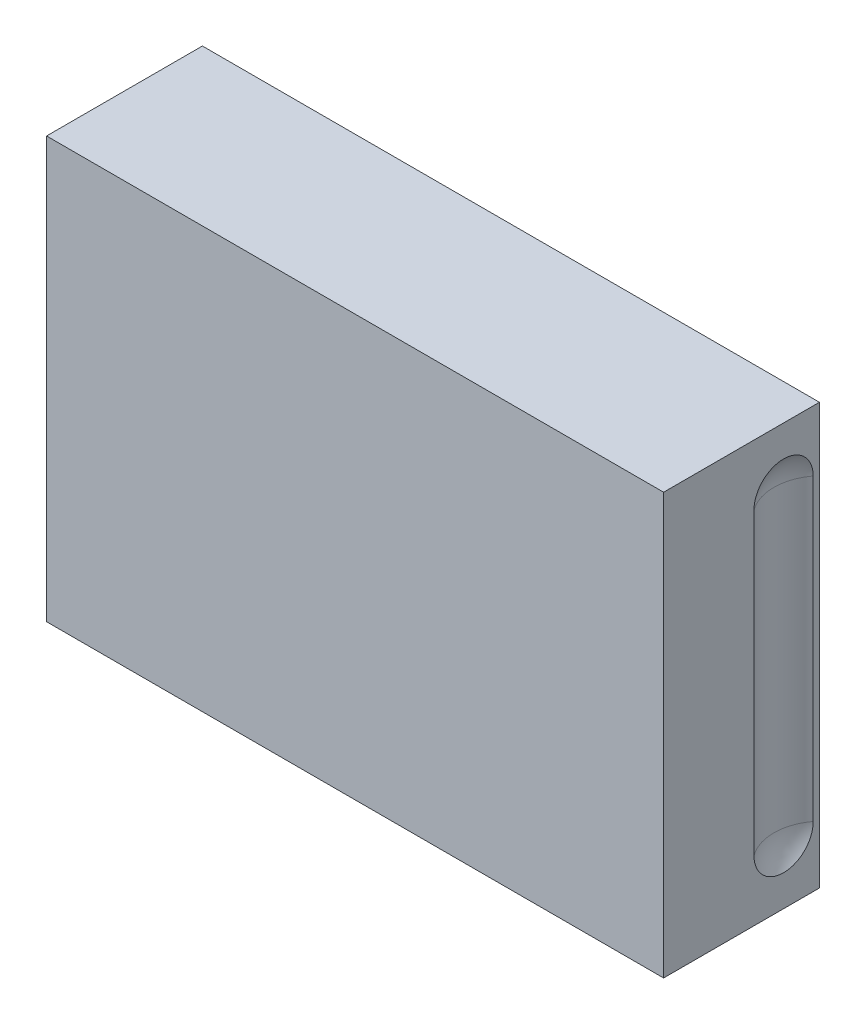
ISO-10303-21;
HEADER;
FILE_DESCRIPTION(('STEP AP214'),'2;1');
FILE_NAME('part.step','',(''),(''),'','','');
FILE_SCHEMA(('AUTOMOTIVE_DESIGN { 1 0 10303 214 1 1 1 1 }'));
ENDSEC;
DATA;
#1=APPLICATION_CONTEXT('core data for automotive mechanical design processes');
#2=APPLICATION_PROTOCOL_DEFINITION('international standard','automotive_design',2000,#1);
#3=PRODUCT_CONTEXT('',#1,'mechanical');
#4=PRODUCT('Part','Part','',(#3));
#5=PRODUCT_RELATED_PRODUCT_CATEGORY('part','',(#4));
#6=PRODUCT_DEFINITION_FORMATION('','',#4);
#7=PRODUCT_DEFINITION_CONTEXT('part definition',#1,'design');
#8=PRODUCT_DEFINITION('design','',#6,#7);
#9=PRODUCT_DEFINITION_SHAPE('','',#8);
#10=(LENGTH_UNIT() NAMED_UNIT(*) SI_UNIT(.MILLI.,.METRE.));
#11=(NAMED_UNIT(*) PLANE_ANGLE_UNIT() SI_UNIT($,.RADIAN.));
#12=(NAMED_UNIT(*) SI_UNIT($,.STERADIAN.) SOLID_ANGLE_UNIT());
#13=UNCERTAINTY_MEASURE_WITH_UNIT(LENGTH_MEASURE(1.E-05),#10,'distance_accuracy_value','');
#14=(GEOMETRIC_REPRESENTATION_CONTEXT(3) GLOBAL_UNCERTAINTY_ASSIGNED_CONTEXT((#13)) GLOBAL_UNIT_ASSIGNED_CONTEXT((#10,
#11,#12)) REPRESENTATION_CONTEXT('',''));
#15=CARTESIAN_POINT('',(0.,0.,0.));
#16=DIRECTION('',(0.,0.,1.));
#17=DIRECTION('',(1.,0.,0.));
#18=AXIS2_PLACEMENT_3D('',#15,#16,#17);
#19=CARTESIAN_POINT('',(-136.01541197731,78.7995880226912,83.));
#20=DIRECTION('',(0.,0.,-1.));
#21=DIRECTION('',(-1.,0.,0.));
#22=AXIS2_PLACEMENT_3D('',#19,#20,#21);
#23=TOROIDAL_SURFACE('',#22,9.00000000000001,2.5);
#24=CARTESIAN_POINT('',(-147.50041197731,78.7995880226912,83.2734501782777));
#25=CARTESIAN_POINT('',(-147.50041197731,78.8523853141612,83.2734552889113));
#26=CARTESIAN_POINT('',(-147.50041197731,78.90520941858,83.2701925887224));
#27=CARTESIAN_POINT('',(-147.50041197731,78.9836502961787,83.2600004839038));
#28=CARTESIAN_POINT('',(-147.50041197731,79.0096313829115,83.2557291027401));
#29=CARTESIAN_POINT('',(-147.50041197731,79.0612155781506,83.2452152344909));
#30=CARTESIAN_POINT('',(-147.50041197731,79.086818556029,83.2389720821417));
#31=CARTESIAN_POINT('',(-147.50041197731,79.1319268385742,83.2257832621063));
#32=CARTESIAN_POINT('',(-147.50041197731,79.1515600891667,83.2192769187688));
#33=CARTESIAN_POINT('',(-147.50041197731,79.1901876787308,83.204608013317));
#34=CARTESIAN_POINT('',(-147.50041197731,79.2091827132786,83.1964473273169));
#35=CARTESIAN_POINT('',(-147.50041197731,79.2463977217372,83.1779977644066));
#36=CARTESIAN_POINT('',(-147.50041197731,79.264606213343,83.1676854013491));
#37=CARTESIAN_POINT('',(-147.50041197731,79.2992587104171,83.1444367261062));
#38=CARTESIAN_POINT('',(-147.500411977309,79.3157105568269,83.1315128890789));
#39=CARTESIAN_POINT('',(-147.50041197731,79.3371665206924,83.1103383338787));
#40=CARTESIAN_POINT('',(-147.50041197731,79.3434882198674,83.1034297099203));
#41=CARTESIAN_POINT('',(-147.50041197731,79.3552200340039,83.0888561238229));
#42=CARTESIAN_POINT('',(-147.50041197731,79.3606295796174,83.0811906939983));
#43=CARTESIAN_POINT('',(-147.50041197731,79.3702638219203,83.0649921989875));
#44=CARTESIAN_POINT('',(-147.50041197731,79.3744718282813,83.056448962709));
#45=CARTESIAN_POINT('',(-147.50041197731,79.3811753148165,83.0387301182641));
#46=CARTESIAN_POINT('',(-147.50041197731,79.3836772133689,83.0295570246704));
#47=CARTESIAN_POINT('',(-147.50041197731,79.3864936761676,83.0118191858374));
#48=CARTESIAN_POINT('',(-147.50041197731,79.3870027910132,83.0032859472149));
#49=CARTESIAN_POINT('',(-147.50041197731,79.386311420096,82.9862928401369));
#50=CARTESIAN_POINT('',(-147.50041197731,79.3851107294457,82.9778329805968));
#51=CARTESIAN_POINT('',(-147.50041197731,79.379732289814,82.9554528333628));
#52=CARTESIAN_POINT('',(-147.50041197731,79.37405212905,82.9418895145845));
#53=CARTESIAN_POINT('',(-147.50041197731,79.3609320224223,82.9189771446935));
#54=CARTESIAN_POINT('',(-147.50041197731,79.354001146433,82.909310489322));
#55=CARTESIAN_POINT('',(-147.50041197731,79.338733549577,82.8911398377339));
#56=CARTESIAN_POINT('',(-147.50041197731,79.3303933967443,82.8826387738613));
#57=CARTESIAN_POINT('',(-147.50041197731,79.3060854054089,82.8606392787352));
#58=CARTESIAN_POINT('',(-147.50041197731,79.2891329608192,82.8482454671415));
#59=CARTESIAN_POINT('',(-147.50041197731,79.2536796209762,82.8259633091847));
#60=CARTESIAN_POINT('',(-147.50041197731,79.2351750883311,82.8160810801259));
#61=CARTESIAN_POINT('',(-147.50041197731,79.1971116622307,82.7982439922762));
#62=CARTESIAN_POINT('',(-147.50041197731,79.1775462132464,82.7903033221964));
#63=CARTESIAN_POINT('',(-147.50041197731,79.1378189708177,82.7760830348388));
#64=CARTESIAN_POINT('',(-147.50041197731,79.117656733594,82.7698046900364));
#65=CARTESIAN_POINT('',(-147.50041197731,79.0564970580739,82.753065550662));
#66=CARTESIAN_POINT('',(-147.50041197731,79.0149100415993,82.7447364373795));
#67=CARTESIAN_POINT('',(-147.50041197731,78.9387826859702,82.7338085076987));
#68=CARTESIAN_POINT('',(-147.50041197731,78.9043416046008,82.7304412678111));
#69=CARTESIAN_POINT('',(-147.50041197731,78.8352661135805,82.7265736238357));
#70=CARTESIAN_POINT('',(-147.50041197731,78.8006315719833,82.7260755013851));
#71=CARTESIAN_POINT('',(-147.50041197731,78.7314761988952,82.7279146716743));
#72=CARTESIAN_POINT('',(-147.50041197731,78.6969552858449,82.7302489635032));
#73=CARTESIAN_POINT('',(-147.50041197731,78.6282642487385,82.7379061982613));
#74=CARTESIAN_POINT('',(-147.50041197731,78.5940938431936,82.7432265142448));
#75=CARTESIAN_POINT('',(-147.50041197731,78.5276303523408,82.7570160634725));
#76=CARTESIAN_POINT('',(-147.500411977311,78.4953133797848,82.7653688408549));
#77=CARTESIAN_POINT('',(-147.500411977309,78.4319654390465,82.7859159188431));
#78=CARTESIAN_POINT('',(-147.500411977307,78.4009302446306,82.798096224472));
#79=CARTESIAN_POINT('',(-147.500411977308,78.3569240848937,82.8199636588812));
#80=CARTESIAN_POINT('',(-147.50041197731,78.3429612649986,82.8276467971));
#81=CARTESIAN_POINT('',(-147.50041197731,78.3159452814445,82.8444560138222));
#82=CARTESIAN_POINT('',(-147.50041197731,78.3028904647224,82.853579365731));
#83=CARTESIAN_POINT('',(-147.50041197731,78.2804496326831,82.871768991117));
#84=CARTESIAN_POINT('',(-147.50041197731,78.2708294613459,82.8805400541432));
#85=CARTESIAN_POINT('',(-147.50041197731,78.2530400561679,82.8994148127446));
#86=CARTESIAN_POINT('',(-147.50041197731,78.244866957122,82.9095148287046));
#87=CARTESIAN_POINT('',(-147.50041197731,78.228710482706,82.9343470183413));
#88=CARTESIAN_POINT('',(-147.50041197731,78.2214240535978,82.9495836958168));
#89=CARTESIAN_POINT('',(-147.50041197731,78.2148574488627,82.9737193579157));
#90=CARTESIAN_POINT('',(-147.50041197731,78.213400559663,82.9820332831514));
#91=CARTESIAN_POINT('',(-147.50041197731,78.21214518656,82.9987883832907));
#92=CARTESIAN_POINT('',(-147.50041197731,78.2123456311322,83.0072294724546));
#93=CARTESIAN_POINT('',(-147.50041197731,78.2142477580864,83.0228241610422));
#94=CARTESIAN_POINT('',(-147.50041197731,78.2157521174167,83.0300031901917));
#95=CARTESIAN_POINT('',(-147.50041197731,78.2198622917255,83.0440462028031));
#96=CARTESIAN_POINT('',(-147.50041197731,78.2224701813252,83.0509095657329));
#97=CARTESIAN_POINT('',(-147.50041197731,78.23432121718,83.0765965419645));
#98=CARTESIAN_POINT('',(-147.50041197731,78.2468761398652,83.0938883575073));
#99=CARTESIAN_POINT('',(-147.50041197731,78.2732469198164,83.1221499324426));
#100=CARTESIAN_POINT('',(-147.50041197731,78.2865264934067,83.1336903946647));
#101=CARTESIAN_POINT('',(-147.50041197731,78.3146322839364,83.1547882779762));
#102=CARTESIAN_POINT('',(-147.50041197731,78.3294627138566,83.1643400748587));
#103=CARTESIAN_POINT('',(-147.50041197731,78.3598439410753,83.1816683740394));
#104=CARTESIAN_POINT('',(-147.50041197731,78.3753829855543,83.1894661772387));
#105=CARTESIAN_POINT('',(-147.50041197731,78.4070643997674,83.2037344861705));
#106=CARTESIAN_POINT('',(-147.50041197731,78.423207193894,83.2102040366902));
#107=CARTESIAN_POINT('',(-147.50041197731,78.4722697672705,83.2279283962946));
#108=CARTESIAN_POINT('',(-147.50041197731,78.5058007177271,83.2374868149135));
#109=CARTESIAN_POINT('',(-147.50041197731,78.582260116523,83.2550274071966));
#110=CARTESIAN_POINT('',(-147.50041197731,78.6254122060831,83.2619925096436));
#111=CARTESIAN_POINT('',(-147.50041197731,78.7122324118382,83.271204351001));
#112=CARTESIAN_POINT('',(-147.50041197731,78.7559010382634,83.273445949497));
#113=CARTESIAN_POINT('',(-147.50041197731,78.7995880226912,83.2734501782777));
#114=B_SPLINE_CURVE_WITH_KNOTS('',3,(#24,#25,#26,#27,#28,#29,#30,#31,#32,#33,#34,#35,#36,#37,
#38,#39,#40,#41,#42,#43,#44,#45,#46,#47,#48,#49,#50,#51,#52,#53,#54,#55,#56,#57,#58,#59,#60,#61,
#62,#63,#64,#65,#66,#67,#68,#69,#70,#71,#72,#73,#74,#75,#76,#77,#78,#79,#80,#81,#82,#83,#84,#85,
#86,#87,#88,#89,#90,#91,#92,#93,#94,#95,#96,#97,#98,#99,#100,#101,#102,#103,#104,#105,#106,#107,
#108,#109,#110,#111,#112,#113),.UNSPECIFIED.,.T.,.F.,(4,2,2,2,2,2,2,2,2,2,2,2,2,2,2,2,2,2,2,2,2,
2,2,2,2,2,2,2,2,2,2,2,2,2,2,2,2,2,2,2,2,2,2,2,4),(0.,0.158280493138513,0.237215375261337,
0.31617691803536,0.378168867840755,0.440090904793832,0.502727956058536,0.56507257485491,
0.593109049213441,0.621162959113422,0.649589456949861,0.67790841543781,0.703381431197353,
0.72885749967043,0.772301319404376,0.80783110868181,0.84344870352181,0.906101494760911,
0.968905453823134,1.03215550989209,1.09545384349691,1.22232014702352,1.326030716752,
1.42982374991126,1.53350691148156,1.6370990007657,1.73707341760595,1.83668645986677,
1.88443333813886,1.93209088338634,1.97102529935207,2.00985409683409,2.05957979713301,
2.08475480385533,2.10991353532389,2.13182148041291,2.15377079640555,2.2165997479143,
2.269220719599,2.32198854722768,2.3740760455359,2.426200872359,2.5305277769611,2.66135426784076,
2.79232305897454),.UNSPECIFIED.);
#115=CARTESIAN_POINT('',(-147.50041197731,78.7995880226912,83.2734501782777));
#116=VERTEX_POINT('',#115);
#117=EDGE_CURVE('E18',#116,#116,#114,.T.);
#118=ORIENTED_EDGE('',*,*,#117,.F.);
#119=EDGE_LOOP('',(#118));
#120=FACE_BOUND('',#119,.T.);
#121=ADVANCED_FACE('F14',(#120),#23,.F.);
#122=CARTESIAN_POINT('',(-136.01541197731,137.799588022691,83.));
#123=DIRECTION('',(0.,0.,-1.));
#124=DIRECTION('',(-1.,0.,0.));
#125=AXIS2_PLACEMENT_3D('',#122,#123,#124);
#126=TOROIDAL_SURFACE('',#125,9.00000000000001,2.5);
#127=CARTESIAN_POINT('',(-147.50041197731,137.799588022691,83.2734501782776));
#128=CARTESIAN_POINT('',(-147.50041197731,137.852385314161,83.2734552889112));
#129=CARTESIAN_POINT('',(-147.50041197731,137.90520941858,83.2701925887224));
#130=CARTESIAN_POINT('',(-147.50041197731,137.983650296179,83.260000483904));
#131=CARTESIAN_POINT('',(-147.50041197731,138.009631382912,83.2557291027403));
#132=CARTESIAN_POINT('',(-147.50041197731,138.061215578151,83.2452152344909));
#133=CARTESIAN_POINT('',(-147.50041197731,138.086818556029,83.2389720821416));
#134=CARTESIAN_POINT('',(-147.50041197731,138.131926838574,83.2257832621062));
#135=CARTESIAN_POINT('',(-147.50041197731,138.151560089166,83.2192769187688));
#136=CARTESIAN_POINT('',(-147.50041197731,138.19018767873,83.2046080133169));
#137=CARTESIAN_POINT('',(-147.50041197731,138.209182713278,83.1964473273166));
#138=CARTESIAN_POINT('',(-147.50041197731,138.246397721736,83.1779977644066));
#139=CARTESIAN_POINT('',(-147.50041197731,138.264606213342,83.1676854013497));
#140=CARTESIAN_POINT('',(-147.50041197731,138.299258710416,83.1444367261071));
#141=CARTESIAN_POINT('',(-147.500411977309,138.315710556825,83.1315128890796));
#142=CARTESIAN_POINT('',(-147.50041197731,138.337166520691,83.1103383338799));
#143=CARTESIAN_POINT('',(-147.50041197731,138.343488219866,83.1034297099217));
#144=CARTESIAN_POINT('',(-147.50041197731,138.355220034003,83.0888561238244));
#145=CARTESIAN_POINT('',(-147.50041197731,138.360629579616,83.0811906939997));
#146=CARTESIAN_POINT('',(-147.50041197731,138.370263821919,83.0649921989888));
#147=CARTESIAN_POINT('',(-147.50041197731,138.37447182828,83.0564489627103));
#148=CARTESIAN_POINT('',(-147.50041197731,138.381175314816,83.0387301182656));
#149=CARTESIAN_POINT('',(-147.50041197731,138.383677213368,83.029557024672));
#150=CARTESIAN_POINT('',(-147.50041197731,138.386493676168,83.011819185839));
#151=CARTESIAN_POINT('',(-147.50041197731,138.387002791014,83.0032859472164));
#152=CARTESIAN_POINT('',(-147.50041197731,138.386311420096,82.9862928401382));
#153=CARTESIAN_POINT('',(-147.50041197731,138.385110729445,82.977832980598));
#154=CARTESIAN_POINT('',(-147.50041197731,138.379732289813,82.9554528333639));
#155=CARTESIAN_POINT('',(-147.50041197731,138.37405212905,82.9418895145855));
#156=CARTESIAN_POINT('',(-147.50041197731,138.360932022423,82.9189771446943));
#157=CARTESIAN_POINT('',(-147.50041197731,138.354001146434,82.9093104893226));
#158=CARTESIAN_POINT('',(-147.50041197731,138.338733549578,82.8911398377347));
#159=CARTESIAN_POINT('',(-147.50041197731,138.330393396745,82.8826387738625));
#160=CARTESIAN_POINT('',(-147.50041197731,138.306085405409,82.8606392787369));
#161=CARTESIAN_POINT('',(-147.50041197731,138.28913296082,82.8482454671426));
#162=CARTESIAN_POINT('',(-147.50041197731,138.253679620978,82.8259633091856));
#163=CARTESIAN_POINT('',(-147.50041197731,138.235175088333,82.8160810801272));
#164=CARTESIAN_POINT('',(-147.50041197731,138.197111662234,82.7982439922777));
#165=CARTESIAN_POINT('',(-147.50041197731,138.17754621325,82.7903033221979));
#166=CARTESIAN_POINT('',(-147.50041197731,138.137818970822,82.7760830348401));
#167=CARTESIAN_POINT('',(-147.50041197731,138.117656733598,82.7698046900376));
#168=CARTESIAN_POINT('',(-147.50041197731,138.056497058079,82.753065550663));
#169=CARTESIAN_POINT('',(-147.50041197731,138.014910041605,82.7447364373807));
#170=CARTESIAN_POINT('',(-147.50041197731,137.938782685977,82.7338085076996));
#171=CARTESIAN_POINT('',(-147.50041197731,137.904341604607,82.7304412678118));
#172=CARTESIAN_POINT('',(-147.50041197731,137.835266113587,82.7265736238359));
#173=CARTESIAN_POINT('',(-147.50041197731,137.80063157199,82.726075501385));
#174=CARTESIAN_POINT('',(-147.50041197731,137.731476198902,82.7279146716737));
#175=CARTESIAN_POINT('',(-147.50041197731,137.696955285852,82.7302489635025));
#176=CARTESIAN_POINT('',(-147.50041197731,137.628264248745,82.7379061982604));
#177=CARTESIAN_POINT('',(-147.50041197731,137.594093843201,82.743226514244));
#178=CARTESIAN_POINT('',(-147.50041197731,137.527630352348,82.7570160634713));
#179=CARTESIAN_POINT('',(-147.500411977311,137.495313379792,82.7653688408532));
#180=CARTESIAN_POINT('',(-147.500411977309,137.431965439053,82.7859159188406));
#181=CARTESIAN_POINT('',(-147.500411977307,137.400930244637,82.7980962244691));
#182=CARTESIAN_POINT('',(-147.500411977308,137.356924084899,82.8199636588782));
#183=CARTESIAN_POINT('',(-147.50041197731,137.342961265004,82.8276467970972));
#184=CARTESIAN_POINT('',(-147.50041197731,137.315945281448,82.8444560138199));
#185=CARTESIAN_POINT('',(-147.50041197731,137.302890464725,82.853579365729));
#186=CARTESIAN_POINT('',(-147.50041197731,137.280449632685,82.8717689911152));
#187=CARTESIAN_POINT('',(-147.50041197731,137.270829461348,82.8805400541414));
#188=CARTESIAN_POINT('',(-147.50041197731,137.25304005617,82.8994148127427));
#189=CARTESIAN_POINT('',(-147.50041197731,137.244866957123,82.9095148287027));
#190=CARTESIAN_POINT('',(-147.50041197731,137.228710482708,82.9343470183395));
#191=CARTESIAN_POINT('',(-147.50041197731,137.2214240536,82.9495836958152));
#192=CARTESIAN_POINT('',(-147.50041197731,137.214857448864,82.9737193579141));
#193=CARTESIAN_POINT('',(-147.50041197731,137.213400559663,82.9820332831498));
#194=CARTESIAN_POINT('',(-147.50041197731,137.21214518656,82.9987883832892));
#195=CARTESIAN_POINT('',(-147.50041197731,137.212345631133,83.0072294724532));
#196=CARTESIAN_POINT('',(-147.50041197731,137.214247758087,83.022824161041));
#197=CARTESIAN_POINT('',(-147.50041197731,137.215752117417,83.0300031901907));
#198=CARTESIAN_POINT('',(-147.50041197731,137.219862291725,83.0440462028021));
#199=CARTESIAN_POINT('',(-147.50041197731,137.222470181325,83.0509095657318));
#200=CARTESIAN_POINT('',(-147.50041197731,137.23432121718,83.0765965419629));
#201=CARTESIAN_POINT('',(-147.50041197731,137.246876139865,83.0938883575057));
#202=CARTESIAN_POINT('',(-147.50041197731,137.273246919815,83.1221499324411));
#203=CARTESIAN_POINT('',(-147.50041197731,137.286526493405,83.1336903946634));
#204=CARTESIAN_POINT('',(-147.50041197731,137.314632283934,83.1547882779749));
#205=CARTESIAN_POINT('',(-147.50041197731,137.329462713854,83.1643400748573));
#206=CARTESIAN_POINT('',(-147.50041197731,137.359843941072,83.1816683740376));
#207=CARTESIAN_POINT('',(-147.50041197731,137.375382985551,83.1894661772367));
#208=CARTESIAN_POINT('',(-147.50041197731,137.407064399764,83.2037344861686));
#209=CARTESIAN_POINT('',(-147.50041197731,137.42320719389,83.2102040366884));
#210=CARTESIAN_POINT('',(-147.50041197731,137.472269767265,83.2279283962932));
#211=CARTESIAN_POINT('',(-147.50041197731,137.505800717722,83.2374868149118));
#212=CARTESIAN_POINT('',(-147.50041197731,137.582260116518,83.2550274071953));
#213=CARTESIAN_POINT('',(-147.50041197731,137.625412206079,83.2619925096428));
#214=CARTESIAN_POINT('',(-147.50041197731,137.712232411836,83.2712043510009));
#215=CARTESIAN_POINT('',(-147.50041197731,137.755901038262,83.2734459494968));
#216=CARTESIAN_POINT('',(-147.50041197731,137.799588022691,83.2734501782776));
#217=B_SPLINE_CURVE_WITH_KNOTS('',3,(#127,#128,#129,#130,#131,#132,#133,#134,#135,#136,#137,
#138,#139,#140,#141,#142,#143,#144,#145,#146,#147,#148,#149,#150,#151,#152,#153,#154,#155,#156,
#157,#158,#159,#160,#161,#162,#163,#164,#165,#166,#167,#168,#169,#170,#171,#172,#173,#174,#175,
#176,#177,#178,#179,#180,#181,#182,#183,#184,#185,#186,#187,#188,#189,#190,#191,#192,#193,#194,
#195,#196,#197,#198,#199,#200,#201,#202,#203,#204,#205,#206,#207,#208,#209,#210,#211,#212,#213,
#214,#215,#216),.UNSPECIFIED.,.T.,.F.,(4,2,2,2,2,2,2,2,2,2,2,2,2,2,2,2,2,2,2,2,2,2,2,2,2,2,2,2,
2,2,2,2,2,2,2,2,2,2,2,2,2,2,2,2,4),(0.,0.15828049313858,0.237215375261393,0.316176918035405,
0.378168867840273,0.440090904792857,0.502727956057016,0.565072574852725,0.593109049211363,
0.621162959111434,0.649589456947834,0.677908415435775,0.703381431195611,0.728857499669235,
0.772301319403,0.807831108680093,0.843448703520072,0.906101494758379,0.968905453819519,
1.03215550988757,1.09545384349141,1.22232014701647,1.32603071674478,1.42982374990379,
1.53350691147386,1.63709900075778,1.73707341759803,1.83668645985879,1.884433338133,
1.93209088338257,1.97102529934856,2.00985409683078,2.05957979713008,2.08475480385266,
2.10991353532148,2.13182148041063,2.15377079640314,2.21659974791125,2.26922071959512,
2.32198854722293,2.37407604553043,2.42620087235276,2.53052777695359,2.66135426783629,
2.79232305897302),.UNSPECIFIED.);
#218=CARTESIAN_POINT('',(-147.50041197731,137.799588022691,83.2734501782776));
#219=VERTEX_POINT('',#218);
#220=EDGE_CURVE('E481',#219,#219,#217,.T.);
#221=ORIENTED_EDGE('',*,*,#220,.F.);
#222=EDGE_LOOP('',(#221));
#223=FACE_BOUND('',#222,.T.);
#224=ADVANCED_FACE('F445',(#223),#126,.F.);
#225=CARTESIAN_POINT('',(-112.98541197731,78.7995880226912,83.));
#226=DIRECTION('',(0.,0.,-1.));
#227=DIRECTION('',(-1.,0.,0.));
#228=AXIS2_PLACEMENT_3D('',#225,#226,#227);
#229=TOROIDAL_SURFACE('',#228,8.99999999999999,2.5);
#230=CARTESIAN_POINT('',(-101.50041197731,78.7995880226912,83.2734501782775));
#231=CARTESIAN_POINT('',(-101.50041197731,78.7467907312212,83.2734552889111));
#232=CARTESIAN_POINT('',(-101.50041197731,78.6939666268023,83.2701925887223));
#233=CARTESIAN_POINT('',(-101.50041197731,78.6155257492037,83.2600004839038));
#234=CARTESIAN_POINT('',(-101.50041197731,78.5895446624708,83.2557291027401));
#235=CARTESIAN_POINT('',(-101.50041197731,78.5379604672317,83.2452152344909));
#236=CARTESIAN_POINT('',(-101.50041197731,78.5123574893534,83.2389720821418));
#237=CARTESIAN_POINT('',(-101.50041197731,78.4672492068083,83.2257832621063));
#238=CARTESIAN_POINT('',(-101.50041197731,78.447615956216,83.2192769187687));
#239=CARTESIAN_POINT('',(-101.50041197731,78.4089883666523,83.2046080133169));
#240=CARTESIAN_POINT('',(-101.50041197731,78.3899933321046,83.1964473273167));
#241=CARTESIAN_POINT('',(-101.50041197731,78.3527783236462,83.1779977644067));
#242=CARTESIAN_POINT('',(-101.50041197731,78.3345698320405,83.1676854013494));
#243=CARTESIAN_POINT('',(-101.50041197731,78.2999173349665,83.1444367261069));
#244=CARTESIAN_POINT('',(-101.50041197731,78.2834654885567,83.1315128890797));
#245=CARTESIAN_POINT('',(-101.50041197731,78.2620095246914,83.1103383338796));
#246=CARTESIAN_POINT('',(-101.50041197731,78.2556878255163,83.1034297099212));
#247=CARTESIAN_POINT('',(-101.50041197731,78.2439560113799,83.0888561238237));
#248=CARTESIAN_POINT('',(-101.50041197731,78.2385464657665,83.081190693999));
#249=CARTESIAN_POINT('',(-101.50041197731,78.2289122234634,83.0649921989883));
#250=CARTESIAN_POINT('',(-101.50041197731,78.2247042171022,83.0564489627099));
#251=CARTESIAN_POINT('',(-101.50041197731,78.2180007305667,83.0387301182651));
#252=CARTESIAN_POINT('',(-101.50041197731,78.2154988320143,83.0295570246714));
#253=CARTESIAN_POINT('',(-101.50041197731,78.2126823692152,83.0118191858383));
#254=CARTESIAN_POINT('',(-101.50041197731,78.2121732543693,83.0032859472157));
#255=CARTESIAN_POINT('',(-101.50041197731,78.2128646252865,82.9862928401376));
#256=CARTESIAN_POINT('',(-101.50041197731,78.2140653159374,82.9778329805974));
#257=CARTESIAN_POINT('',(-101.50041197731,78.2194437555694,82.9554528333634));
#258=CARTESIAN_POINT('',(-101.50041197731,78.2251239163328,82.9418895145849));
#259=CARTESIAN_POINT('',(-101.50041197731,78.23824402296,82.9189771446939));
#260=CARTESIAN_POINT('',(-101.50041197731,78.2451748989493,82.9093104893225));
#261=CARTESIAN_POINT('',(-101.50041197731,78.2604424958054,82.8911398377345));
#262=CARTESIAN_POINT('',(-101.50041197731,78.2687826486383,82.8826387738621));
#263=CARTESIAN_POINT('',(-101.50041197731,78.2930906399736,82.8606392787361));
#264=CARTESIAN_POINT('',(-101.50041197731,78.3100430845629,82.848245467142));
#265=CARTESIAN_POINT('',(-101.50041197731,78.3454964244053,82.825963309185));
#266=CARTESIAN_POINT('',(-101.50041197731,78.3640009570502,82.8160810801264));
#267=CARTESIAN_POINT('',(-101.50041197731,78.4020643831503,82.7982439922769));
#268=CARTESIAN_POINT('',(-101.50041197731,78.4216298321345,82.7903033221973));
#269=CARTESIAN_POINT('',(-101.50041197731,78.4613570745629,82.7760830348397));
#270=CARTESIAN_POINT('',(-101.50041197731,78.4815193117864,82.7698046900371));
#271=CARTESIAN_POINT('',(-101.50041197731,78.542678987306,82.7530655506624));
#272=CARTESIAN_POINT('',(-101.50041197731,78.5842660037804,82.7447364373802));
#273=CARTESIAN_POINT('',(-101.50041197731,78.6603933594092,82.7338085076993));
#274=CARTESIAN_POINT('',(-101.50041197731,78.6948344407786,82.7304412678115));
#275=CARTESIAN_POINT('',(-101.50041197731,78.7639099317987,82.7265736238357));
#276=CARTESIAN_POINT('',(-101.50041197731,78.7985444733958,82.7260755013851));
#277=CARTESIAN_POINT('',(-101.50041197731,78.8676998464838,82.7279146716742));
#278=CARTESIAN_POINT('',(-101.50041197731,78.902220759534,82.7302489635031));
#279=CARTESIAN_POINT('',(-101.50041197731,78.9709117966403,82.7379061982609));
#280=CARTESIAN_POINT('',(-101.50041197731,79.005082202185,82.7432265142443));
#281=CARTESIAN_POINT('',(-101.50041197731,79.0715456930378,82.7570160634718));
#282=CARTESIAN_POINT('',(-101.500411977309,79.1038626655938,82.7653688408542));
#283=CARTESIAN_POINT('',(-101.500411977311,79.1672106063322,82.785915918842));
#284=CARTESIAN_POINT('',(-101.500411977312,79.1982458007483,82.7980962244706));
#285=CARTESIAN_POINT('',(-101.500411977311,79.2422519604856,82.8199636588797));
#286=CARTESIAN_POINT('',(-101.50041197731,79.2562147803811,82.8276467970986));
#287=CARTESIAN_POINT('',(-101.50041197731,79.2832307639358,82.8444560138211));
#288=CARTESIAN_POINT('',(-101.50041197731,79.2962855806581,82.8535793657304));
#289=CARTESIAN_POINT('',(-101.50041197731,79.3187264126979,82.8717689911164));
#290=CARTESIAN_POINT('',(-101.50041197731,79.3283465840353,82.8805400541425));
#291=CARTESIAN_POINT('',(-101.50041197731,79.3461359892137,82.8994148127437));
#292=CARTESIAN_POINT('',(-101.50041197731,79.3543090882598,82.9095148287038));
#293=CARTESIAN_POINT('',(-101.50041197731,79.3704655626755,82.9343470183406));
#294=CARTESIAN_POINT('',(-101.50041197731,79.3777519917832,82.9495836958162));
#295=CARTESIAN_POINT('',(-101.50041197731,79.3843185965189,82.9737193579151));
#296=CARTESIAN_POINT('',(-101.50041197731,79.3857754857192,82.9820332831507));
#297=CARTESIAN_POINT('',(-101.50041197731,79.3870308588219,82.99878838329));
#298=CARTESIAN_POINT('',(-101.50041197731,79.3868304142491,83.007229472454));
#299=CARTESIAN_POINT('',(-101.50041197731,79.384928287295,83.0228241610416));
#300=CARTESIAN_POINT('',(-101.50041197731,79.3834239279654,83.0300031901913));
#301=CARTESIAN_POINT('',(-101.50041197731,79.379313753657,83.0440462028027));
#302=CARTESIAN_POINT('',(-101.50041197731,79.3767058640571,83.0509095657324));
#303=CARTESIAN_POINT('',(-101.50041197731,79.364854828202,83.0765965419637));
#304=CARTESIAN_POINT('',(-101.50041197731,79.3522999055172,83.0938883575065));
#305=CARTESIAN_POINT('',(-101.50041197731,79.3259291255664,83.1221499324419));
#306=CARTESIAN_POINT('',(-101.50041197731,79.3126495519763,83.1336903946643));
#307=CARTESIAN_POINT('',(-101.50041197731,79.2845437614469,83.1547882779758));
#308=CARTESIAN_POINT('',(-101.50041197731,79.2697133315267,83.1643400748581));
#309=CARTESIAN_POINT('',(-101.50041197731,79.2393321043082,83.1816683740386));
#310=CARTESIAN_POINT('',(-101.50041197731,79.2237930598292,83.1894661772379));
#311=CARTESIAN_POINT('',(-101.50041197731,79.1921116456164,83.2037344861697));
#312=CARTESIAN_POINT('',(-101.50041197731,79.17596885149,83.2102040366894));
#313=CARTESIAN_POINT('',(-101.50041197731,79.1269062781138,83.2279283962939));
#314=CARTESIAN_POINT('',(-101.50041197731,79.0933753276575,83.2374868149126));
#315=CARTESIAN_POINT('',(-101.50041197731,79.0169159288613,83.2550274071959));
#316=CARTESIAN_POINT('',(-101.50041197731,78.9737638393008,83.2619925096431));
#317=CARTESIAN_POINT('',(-101.50041197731,78.886943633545,83.2712043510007));
#318=CARTESIAN_POINT('',(-101.50041197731,78.8432750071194,83.2734459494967));
#319=CARTESIAN_POINT('',(-101.50041197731,78.7995880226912,83.2734501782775));
#320=B_SPLINE_CURVE_WITH_KNOTS('',3,(#230,#231,#232,#233,#234,#235,#236,#237,#238,#239,#240,
#241,#242,#243,#244,#245,#246,#247,#248,#249,#250,#251,#252,#253,#254,#255,#256,#257,#258,#259,
#260,#261,#262,#263,#264,#265,#266,#267,#268,#269,#270,#271,#272,#273,#274,#275,#276,#277,#278,
#279,#280,#281,#282,#283,#284,#285,#286,#287,#288,#289,#290,#291,#292,#293,#294,#295,#296,#297,
#298,#299,#300,#301,#302,#303,#304,#305,#306,#307,#308,#309,#310,#311,#312,#313,#314,#315,#316,
#317,#318,#319),.UNSPECIFIED.,.T.,.F.,(4,2,2,2,2,2,2,2,2,2,2,2,2,2,2,2,2,2,2,2,2,2,2,2,2,2,2,2,
2,2,2,2,2,2,2,2,2,2,2,2,2,2,2,2,4),(0.,0.158280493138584,0.237215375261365,0.316176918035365,
0.378168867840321,0.440090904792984,0.502727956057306,0.565072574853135,0.593109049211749,
0.621162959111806,0.64958945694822,0.677908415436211,0.703381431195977,0.728857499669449,
0.772301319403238,0.807831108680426,0.843448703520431,0.906101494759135,0.96890545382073,
1.03215550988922,1.09545384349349,1.22232014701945,1.32603071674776,1.4298237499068,
1.53350691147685,1.63709900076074,1.73707341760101,1.83668645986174,1.88443333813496,
1.9320908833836,1.97102529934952,2.00985409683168,2.05957979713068,2.08475480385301,
2.10991353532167,2.13182148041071,2.15377079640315,2.21659974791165,2.2692207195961,
2.32198854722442,2.37407604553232,2.42620087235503,2.53052777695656,2.66135426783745,
2.79232305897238),.UNSPECIFIED.);
#321=CARTESIAN_POINT('',(-101.50041197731,78.7995880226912,83.2734501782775));
#322=VERTEX_POINT('',#321);
#323=EDGE_CURVE('E272',#322,#322,#320,.T.);
#324=ORIENTED_EDGE('',*,*,#323,.F.);
#325=EDGE_LOOP('',(#324));
#326=FACE_BOUND('',#325,.T.);
#327=ADVANCED_FACE('F437',(#326),#229,.F.);
#328=CARTESIAN_POINT('',(-112.98541197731,137.799588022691,83.));
#329=DIRECTION('',(0.,0.,-1.));
#330=DIRECTION('',(-1.,0.,0.));
#331=AXIS2_PLACEMENT_3D('',#328,#329,#330);
#332=TOROIDAL_SURFACE('',#331,8.99999999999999,2.5);
#333=CARTESIAN_POINT('',(-101.50041197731,137.799588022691,83.2734501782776));
#334=CARTESIAN_POINT('',(-101.50041197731,137.746790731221,83.2734552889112));
#335=CARTESIAN_POINT('',(-101.50041197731,137.693966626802,83.2701925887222));
#336=CARTESIAN_POINT('',(-101.50041197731,137.615525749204,83.2600004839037));
#337=CARTESIAN_POINT('',(-101.50041197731,137.589544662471,83.2557291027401));
#338=CARTESIAN_POINT('',(-101.50041197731,137.537960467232,83.245215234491));
#339=CARTESIAN_POINT('',(-101.50041197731,137.512357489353,83.2389720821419));
#340=CARTESIAN_POINT('',(-101.50041197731,137.467249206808,83.2257832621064));
#341=CARTESIAN_POINT('',(-101.50041197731,137.447615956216,83.2192769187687));
#342=CARTESIAN_POINT('',(-101.50041197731,137.408988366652,83.2046080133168));
#343=CARTESIAN_POINT('',(-101.50041197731,137.389993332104,83.1964473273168));
#344=CARTESIAN_POINT('',(-101.50041197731,137.352778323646,83.1779977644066));
#345=CARTESIAN_POINT('',(-101.50041197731,137.33456983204,83.1676854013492));
#346=CARTESIAN_POINT('',(-101.50041197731,137.299917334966,83.1444367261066));
#347=CARTESIAN_POINT('',(-101.50041197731,137.283465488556,83.1315128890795));
#348=CARTESIAN_POINT('',(-101.50041197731,137.262009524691,83.1103383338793));
#349=CARTESIAN_POINT('',(-101.50041197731,137.255687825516,83.1034297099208));
#350=CARTESIAN_POINT('',(-101.50041197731,137.24395601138,83.0888561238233));
#351=CARTESIAN_POINT('',(-101.50041197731,137.238546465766,83.0811906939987));
#352=CARTESIAN_POINT('',(-101.50041197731,137.228912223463,83.064992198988));
#353=CARTESIAN_POINT('',(-101.50041197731,137.224704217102,83.0564489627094));
#354=CARTESIAN_POINT('',(-101.50041197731,137.218000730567,83.0387301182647));
#355=CARTESIAN_POINT('',(-101.50041197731,137.215498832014,83.0295570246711));
#356=CARTESIAN_POINT('',(-101.50041197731,137.212682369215,83.0118191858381));
#357=CARTESIAN_POINT('',(-101.50041197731,137.212173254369,83.0032859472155));
#358=CARTESIAN_POINT('',(-101.50041197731,137.212864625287,82.9862928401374));
#359=CARTESIAN_POINT('',(-101.50041197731,137.214065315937,82.9778329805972));
#360=CARTESIAN_POINT('',(-101.50041197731,137.219443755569,82.9554528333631));
#361=CARTESIAN_POINT('',(-101.50041197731,137.225123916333,82.9418895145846));
#362=CARTESIAN_POINT('',(-101.50041197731,137.23824402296,82.9189771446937));
#363=CARTESIAN_POINT('',(-101.50041197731,137.245174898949,82.9093104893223));
#364=CARTESIAN_POINT('',(-101.50041197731,137.260442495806,82.8911398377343));
#365=CARTESIAN_POINT('',(-101.50041197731,137.268782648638,82.8826387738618));
#366=CARTESIAN_POINT('',(-101.50041197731,137.293090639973,82.8606392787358));
#367=CARTESIAN_POINT('',(-101.50041197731,137.310043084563,82.8482454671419));
#368=CARTESIAN_POINT('',(-101.50041197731,137.345496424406,82.8259633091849));
#369=CARTESIAN_POINT('',(-101.50041197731,137.364000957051,82.8160810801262));
#370=CARTESIAN_POINT('',(-101.50041197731,137.402064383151,82.7982439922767));
#371=CARTESIAN_POINT('',(-101.50041197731,137.421629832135,82.7903033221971));
#372=CARTESIAN_POINT('',(-101.50041197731,137.461357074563,82.7760830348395));
#373=CARTESIAN_POINT('',(-101.50041197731,137.481519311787,82.7698046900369));
#374=CARTESIAN_POINT('',(-101.50041197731,137.542678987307,82.7530655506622));
#375=CARTESIAN_POINT('',(-101.50041197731,137.584266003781,82.7447364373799));
#376=CARTESIAN_POINT('',(-101.50041197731,137.66039335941,82.7338085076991));
#377=CARTESIAN_POINT('',(-101.50041197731,137.69483444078,82.7304412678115));
#378=CARTESIAN_POINT('',(-101.50041197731,137.7639099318,82.7265736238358));
#379=CARTESIAN_POINT('',(-101.50041197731,137.798544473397,82.7260755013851));
#380=CARTESIAN_POINT('',(-101.50041197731,137.867699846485,82.7279146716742));
#381=CARTESIAN_POINT('',(-101.50041197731,137.902220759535,82.7302489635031));
#382=CARTESIAN_POINT('',(-101.50041197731,137.970911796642,82.737906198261));
#383=CARTESIAN_POINT('',(-101.50041197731,138.005082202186,82.7432265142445));
#384=CARTESIAN_POINT('',(-101.50041197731,138.071545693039,82.7570160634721));
#385=CARTESIAN_POINT('',(-101.500411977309,138.103862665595,82.7653688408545));
#386=CARTESIAN_POINT('',(-101.500411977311,138.167210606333,82.7859159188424));
#387=CARTESIAN_POINT('',(-101.500411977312,138.198245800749,82.7980962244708));
#388=CARTESIAN_POINT('',(-101.500411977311,138.242251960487,82.81996365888));
#389=CARTESIAN_POINT('',(-101.50041197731,138.256214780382,82.8276467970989));
#390=CARTESIAN_POINT('',(-101.50041197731,138.283230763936,82.8444560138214));
#391=CARTESIAN_POINT('',(-101.50041197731,138.296285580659,82.8535793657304));
#392=CARTESIAN_POINT('',(-101.50041197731,138.318726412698,82.8717689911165));
#393=CARTESIAN_POINT('',(-101.50041197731,138.328346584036,82.8805400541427));
#394=CARTESIAN_POINT('',(-101.50041197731,138.346135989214,82.8994148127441));
#395=CARTESIAN_POINT('',(-101.50041197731,138.35430908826,82.9095148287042));
#396=CARTESIAN_POINT('',(-101.50041197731,138.370465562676,82.934347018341));
#397=CARTESIAN_POINT('',(-101.50041197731,138.377751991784,82.9495836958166));
#398=CARTESIAN_POINT('',(-101.50041197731,138.384318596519,82.9737193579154));
#399=CARTESIAN_POINT('',(-101.50041197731,138.385775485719,82.982033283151));
#400=CARTESIAN_POINT('',(-101.50041197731,138.387030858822,82.9987883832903));
#401=CARTESIAN_POINT('',(-101.50041197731,138.386830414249,83.0072294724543));
#402=CARTESIAN_POINT('',(-101.50041197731,138.384928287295,83.0228241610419));
#403=CARTESIAN_POINT('',(-101.50041197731,138.383423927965,83.0300031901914));
#404=CARTESIAN_POINT('',(-101.50041197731,138.379313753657,83.0440462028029));
#405=CARTESIAN_POINT('',(-101.50041197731,138.376705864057,83.0509095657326));
#406=CARTESIAN_POINT('',(-101.50041197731,138.364854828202,83.0765965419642));
#407=CARTESIAN_POINT('',(-101.50041197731,138.352299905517,83.0938883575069));
#408=CARTESIAN_POINT('',(-101.50041197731,138.325929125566,83.1221499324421));
#409=CARTESIAN_POINT('',(-101.50041197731,138.312649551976,83.1336903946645));
#410=CARTESIAN_POINT('',(-101.50041197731,138.284543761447,83.1547882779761));
#411=CARTESIAN_POINT('',(-101.50041197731,138.269713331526,83.1643400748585));
#412=CARTESIAN_POINT('',(-101.50041197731,138.239332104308,83.181668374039));
#413=CARTESIAN_POINT('',(-101.50041197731,138.223793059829,83.1894661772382));
#414=CARTESIAN_POINT('',(-101.50041197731,138.192111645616,83.2037344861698));
#415=CARTESIAN_POINT('',(-101.50041197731,138.175968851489,83.2102040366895));
#416=CARTESIAN_POINT('',(-101.50041197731,138.126906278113,83.2279283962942));
#417=CARTESIAN_POINT('',(-101.50041197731,138.093375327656,83.2374868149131));
#418=CARTESIAN_POINT('',(-101.50041197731,138.01691592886,83.2550274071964));
#419=CARTESIAN_POINT('',(-101.50041197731,137.9737638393,83.2619925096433));
#420=CARTESIAN_POINT('',(-101.50041197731,137.886943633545,83.2712043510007));
#421=CARTESIAN_POINT('',(-101.50041197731,137.843275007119,83.2734459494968));
#422=CARTESIAN_POINT('',(-101.50041197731,137.799588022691,83.2734501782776));
#423=B_SPLINE_CURVE_WITH_KNOTS('',3,(#333,#334,#335,#336,#337,#338,#339,#340,#341,#342,#343,
#344,#345,#346,#347,#348,#349,#350,#351,#352,#353,#354,#355,#356,#357,#358,#359,#360,#361,#362,
#363,#364,#365,#366,#367,#368,#369,#370,#371,#372,#373,#374,#375,#376,#377,#378,#379,#380,#381,
#382,#383,#384,#385,#386,#387,#388,#389,#390,#391,#392,#393,#394,#395,#396,#397,#398,#399,#400,
#401,#402,#403,#404,#405,#406,#407,#408,#409,#410,#411,#412,#413,#414,#415,#416,#417,#418,#419,
#420,#421,#422),.UNSPECIFIED.,.T.,.F.,(4,2,2,2,2,2,2,2,2,2,2,2,2,2,2,2,2,2,2,2,2,2,2,2,2,2,2,2,
2,2,2,2,2,2,2,2,2,2,2,2,2,2,2,2,4),(0.,0.158280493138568,0.237215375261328,0.316176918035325,
0.378168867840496,0.440090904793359,0.502727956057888,0.565072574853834,0.593109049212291,
0.62116295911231,0.649589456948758,0.677908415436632,0.703381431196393,0.72885749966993,
0.772301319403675,0.807831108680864,0.843448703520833,0.906101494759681,0.968905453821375,
1.03215550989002,1.09545384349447,1.22232014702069,1.32603071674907,1.42982374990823,
1.53350691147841,1.63709900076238,1.73707341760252,1.83668645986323,1.88443333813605,
1.93209088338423,1.97102529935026,2.00985409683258,2.05957979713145,2.08475480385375,
2.10991353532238,2.13182148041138,2.15377079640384,2.21659974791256,2.269220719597,
2.32198854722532,2.37407604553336,2.42620087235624,2.53052777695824,2.66135426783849,
2.79232305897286),.UNSPECIFIED.);
#424=CARTESIAN_POINT('',(-101.50041197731,137.799588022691,83.2734501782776));
#425=VERTEX_POINT('',#424);
#426=EDGE_CURVE('E275',#425,#425,#423,.T.);
#427=ORIENTED_EDGE('',*,*,#426,.F.);
#428=EDGE_LOOP('',(#427));
#429=FACE_BOUND('',#428,.T.);
#430=ADVANCED_FACE('F329',(#429),#332,.F.);
#431=CARTESIAN_POINT('',(-124.50041197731,108.299588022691,85.5));
#432=DIRECTION('',(0.,0.,-1.));
#433=DIRECTION('',(-1.,0.,0.));
#434=AXIS2_PLACEMENT_3D('',#431,#432,#433);
#435=PLANE('',#434);
#436=DIRECTION('',(0.,1.,0.));
#437=VECTOR('',#436,1.);
#438=CARTESIAN_POINT('',(-147.50041197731,108.299588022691,85.5));
#439=LINE('',#438,#437);
#440=CARTESIAN_POINT('',(-147.50041197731,155.299588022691,85.5));
#441=VERTEX_POINT('',#440);
#442=CARTESIAN_POINT('',(-147.50041197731,61.2995880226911,85.5));
#443=VERTEX_POINT('',#442);
#444=EDGE_CURVE('E277',#441,#443,#439,.F.);
#445=ORIENTED_EDGE('',*,*,#444,.F.);
#446=DIRECTION('',(1.,0.,0.));
#447=VECTOR('',#446,1.);
#448=CARTESIAN_POINT('',(-124.50041197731,155.299588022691,85.5));
#449=LINE('',#448,#447);
#450=CARTESIAN_POINT('',(-101.50041197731,155.299588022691,85.5));
#451=VERTEX_POINT('',#450);
#452=EDGE_CURVE('E271',#451,#441,#449,.F.);
#453=ORIENTED_EDGE('',*,*,#452,.F.);
#454=DIRECTION('',(0.,1.,0.));
#455=VECTOR('',#454,1.);
#456=CARTESIAN_POINT('',(-101.50041197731,108.299588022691,85.5));
#457=LINE('',#456,#455);
#458=CARTESIAN_POINT('',(-101.50041197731,61.2995880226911,85.5));
#459=VERTEX_POINT('',#458);
#460=EDGE_CURVE('E284',#459,#451,#457,.T.);
#461=ORIENTED_EDGE('',*,*,#460,.F.);
#462=DIRECTION('',(1.,0.,0.));
#463=VECTOR('',#462,1.);
#464=CARTESIAN_POINT('',(-124.50041197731,61.2995880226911,85.5));
#465=LINE('',#464,#463);
#466=EDGE_CURVE('E288',#443,#459,#465,.T.);
#467=ORIENTED_EDGE('',*,*,#466,.F.);
#468=EDGE_LOOP('',(#445,#453,#461,#467));
#469=FACE_BOUND('',#468,.T.);
#470=ADVANCED_FACE('F298',(#469),#435,.T.);
#471=CARTESIAN_POINT('',(-147.50041197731,108.299588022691,77.5));
#472=DIRECTION('',(1.,0.,0.));
#473=DIRECTION('',(0.,0.,-1.));
#474=AXIS2_PLACEMENT_3D('',#471,#472,#473);
#475=PLANE('',#474);
#476=DIRECTION('',(0.,0.,1.));
#477=VECTOR('',#476,1.);
#478=CARTESIAN_POINT('',(-147.50041197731,61.2995880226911,69.6));
#479=LINE('',#478,#477);
#480=CARTESIAN_POINT('',(-147.50041197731,61.2995880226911,69.5));
#481=VERTEX_POINT('',#480);
#482=EDGE_CURVE('E251',#481,#443,#479,.T.);
#483=ORIENTED_EDGE('',*,*,#482,.F.);
#484=DIRECTION('',(0.,-1.,0.));
#485=VECTOR('',#484,1.);
#486=CARTESIAN_POINT('',(-147.50041197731,108.299588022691,69.5));
#487=LINE('',#486,#485);
#488=CARTESIAN_POINT('',(-147.50041197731,155.299588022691,69.5));
#489=VERTEX_POINT('',#488);
#490=EDGE_CURVE('E229',#481,#489,#487,.F.);
#491=ORIENTED_EDGE('',*,*,#490,.T.);
#492=DIRECTION('',(0.,0.,-1.));
#493=VECTOR('',#492,1.);
#494=CARTESIAN_POINT('',(-147.50041197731,155.299588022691,69.6));
#495=LINE('',#494,#493);
#496=EDGE_CURVE('E263',#441,#489,#495,.T.);
#497=ORIENTED_EDGE('',*,*,#496,.F.);
#498=ORIENTED_EDGE('',*,*,#444,.T.);
#499=EDGE_LOOP('',(#483,#491,#497,#498));
#500=FACE_BOUND('',#499,.T.);
#501=ORIENTED_EDGE('',*,*,#220,.T.);
#502=EDGE_LOOP('',(#501));
#503=FACE_BOUND('',#502,.T.);
#504=ORIENTED_EDGE('',*,*,#117,.T.);
#505=EDGE_LOOP('',(#504));
#506=FACE_BOUND('',#505,.T.);
#507=ADVANCED_FACE('F259',(#500,#503,#506),#475,.T.);
#508=CARTESIAN_POINT('',(-124.50041197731,155.299588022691,69.6));
#509=DIRECTION('',(0.,-1.,0.));
#510=DIRECTION('',(0.,0.,-1.));
#511=AXIS2_PLACEMENT_3D('',#508,#509,#510);
#512=PLANE('',#511);
#513=ORIENTED_EDGE('',*,*,#452,.T.);
#514=ORIENTED_EDGE('',*,*,#496,.T.);
#515=DIRECTION('',(1.,0.,0.));
#516=VECTOR('',#515,1.);
#517=CARTESIAN_POINT('',(-124.50041197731,155.299588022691,69.5));
#518=LINE('',#517,#516);
#519=CARTESIAN_POINT('',(-101.50041197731,155.299588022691,69.5));
#520=VERTEX_POINT('',#519);
#521=EDGE_CURVE('E232',#489,#520,#518,.T.);
#522=ORIENTED_EDGE('',*,*,#521,.T.);
#523=DIRECTION('',(0.,0.,1.));
#524=VECTOR('',#523,1.);
#525=CARTESIAN_POINT('',(-101.50041197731,155.299588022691,77.5));
#526=LINE('',#525,#524);
#527=EDGE_CURVE('E282',#451,#520,#526,.F.);
#528=ORIENTED_EDGE('',*,*,#527,.F.);
#529=EDGE_LOOP('',(#513,#514,#522,#528));
#530=FACE_BOUND('',#529,.T.);
#531=ADVANCED_FACE('F268',(#530),#512,.T.);
#532=CARTESIAN_POINT('',(-101.50041197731,108.299588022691,77.5));
#533=DIRECTION('',(-1.,0.,0.));
#534=DIRECTION('',(0.,0.,1.));
#535=AXIS2_PLACEMENT_3D('',#532,#533,#534);
#536=PLANE('',#535);
#537=ORIENTED_EDGE('',*,*,#527,.T.);
#538=DIRECTION('',(0.,-1.,0.));
#539=VECTOR('',#538,1.);
#540=CARTESIAN_POINT('',(-101.50041197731,108.299588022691,69.5));
#541=LINE('',#540,#539);
#542=CARTESIAN_POINT('',(-101.50041197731,61.2995880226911,69.5));
#543=VERTEX_POINT('',#542);
#544=EDGE_CURVE('E234',#520,#543,#541,.T.);
#545=ORIENTED_EDGE('',*,*,#544,.T.);
#546=DIRECTION('',(0.,0.,1.));
#547=VECTOR('',#546,1.);
#548=CARTESIAN_POINT('',(-101.50041197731,61.2995880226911,69.6));
#549=LINE('',#548,#547);
#550=EDGE_CURVE('E86',#459,#543,#549,.F.);
#551=ORIENTED_EDGE('',*,*,#550,.F.);
#552=ORIENTED_EDGE('',*,*,#460,.T.);
#553=EDGE_LOOP('',(#537,#545,#551,#552));
#554=FACE_BOUND('',#553,.T.);
#555=ORIENTED_EDGE('',*,*,#426,.T.);
#556=EDGE_LOOP('',(#555));
#557=FACE_BOUND('',#556,.T.);
#558=ORIENTED_EDGE('',*,*,#323,.T.);
#559=EDGE_LOOP('',(#558));
#560=FACE_BOUND('',#559,.T.);
#561=ADVANCED_FACE('F332',(#554,#557,#560),#536,.T.);
#562=CARTESIAN_POINT('',(-124.50041197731,61.2995880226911,69.6));
#563=DIRECTION('',(0.,1.,0.));
#564=DIRECTION('',(0.,0.,1.));
#565=AXIS2_PLACEMENT_3D('',#562,#563,#564);
#566=PLANE('',#565);
#567=ORIENTED_EDGE('',*,*,#466,.T.);
#568=ORIENTED_EDGE('',*,*,#550,.T.);
#569=DIRECTION('',(1.,0.,0.));
#570=VECTOR('',#569,1.);
#571=CARTESIAN_POINT('',(-124.50041197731,61.2995880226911,69.5));
#572=LINE('',#571,#570);
#573=EDGE_CURVE('E168',#543,#481,#572,.F.);
#574=ORIENTED_EDGE('',*,*,#573,.T.);
#575=ORIENTED_EDGE('',*,*,#482,.T.);
#576=EDGE_LOOP('',(#567,#568,#574,#575));
#577=FACE_BOUND('',#576,.T.);
#578=ADVANCED_FACE('F248',(#577),#566,.T.);
#579=CARTESIAN_POINT('',(-236.250411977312,156.29971960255,81.));
#580=DIRECTION('',(0.881793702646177,0.413127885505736,0.22751970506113));
#581=DIRECTION('',(-0.381417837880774,0.908407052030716,-0.171222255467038));
#582=AXIS2_PLACEMENT_3D('',#579,#580,#581);
#583=SPHERICAL_SURFACE('',#582,15.9);
#584=CARTESIAN_POINT('',(-222.229892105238,162.868452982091,84.617563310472));
#585=VERTEX_POINT('',#584);
#586=VERTEX_LOOP('',#585);
#587=FACE_BOUND('',#586,.T.);
#588=CARTESIAN_POINT('',(-236.250411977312,156.29971960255,81.));
#589=DIRECTION('',(0.,-1.,0.));
#590=DIRECTION('',(0.,0.,-1.));
#591=AXIS2_PLACEMENT_3D('',#588,#589,#590);
#592=CIRCLE('',#591,15.9);
#593=CARTESIAN_POINT('',(-223.500411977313,156.29971960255,71.5001315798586));
#594=VERTEX_POINT('',#593);
#595=CARTESIAN_POINT('',(-223.500411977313,156.29971960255,90.4998684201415));
#596=VERTEX_POINT('',#595);
#597=EDGE_CURVE('E80',#594,#596,#592,.T.);
#598=ORIENTED_EDGE('',*,*,#597,.T.);
#599=CARTESIAN_POINT('',(-223.500411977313,156.29971960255,90.4998684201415));
#600=CARTESIAN_POINT('',(-223.500411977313,156.566906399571,90.4998971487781));
#601=CARTESIAN_POINT('',(-223.500411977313,156.834089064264,90.4885975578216));
#602=CARTESIAN_POINT('',(-223.500411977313,157.366542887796,90.4435492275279));
#603=CARTESIAN_POINT('',(-223.500411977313,157.631814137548,90.4098015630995));
#604=CARTESIAN_POINT('',(-223.500411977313,158.158382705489,90.3200960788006));
#605=CARTESIAN_POINT('',(-223.500411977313,158.419682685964,90.2641538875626));
#606=CARTESIAN_POINT('',(-223.500411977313,158.936640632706,90.1304663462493));
#607=CARTESIAN_POINT('',(-223.500411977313,159.192298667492,90.0527212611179));
#608=CARTESIAN_POINT('',(-223.500411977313,159.696275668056,89.8759367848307));
#609=CARTESIAN_POINT('',(-223.500411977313,159.944591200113,89.7768876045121));
#610=CARTESIAN_POINT('',(-223.500411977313,160.431999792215,89.5582186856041));
#611=CARTESIAN_POINT('',(-223.500411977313,160.671092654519,89.4385985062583));
#612=CARTESIAN_POINT('',(-223.500411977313,161.138302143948,89.1796660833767));
#613=CARTESIAN_POINT('',(-223.500411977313,161.36642101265,89.0403578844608));
#614=CARTESIAN_POINT('',(-223.500411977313,161.810112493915,88.7430218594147));
#615=CARTESIAN_POINT('',(-223.500411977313,162.025685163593,88.584994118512));
#616=CARTESIAN_POINT('',(-223.500411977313,162.442760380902,88.2513359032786));
#617=CARTESIAN_POINT('',(-223.500411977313,162.64426243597,88.0757048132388));
#618=CARTESIAN_POINT('',(-223.500411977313,163.031751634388,87.7080969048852));
#619=CARTESIAN_POINT('',(-223.500411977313,163.217739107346,87.5161204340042));
#620=CARTESIAN_POINT('',(-223.500411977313,163.572910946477,87.1171505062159));
#621=CARTESIAN_POINT('',(-223.500411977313,163.742092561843,86.9101546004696));
#622=CARTESIAN_POINT('',(-223.500411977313,164.062415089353,86.4826454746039));
#623=CARTESIAN_POINT('',(-223.500411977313,164.213556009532,86.2621322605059));
#624=CARTESIAN_POINT('',(-223.500411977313,164.49671632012,85.8091663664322));
#625=CARTESIAN_POINT('',(-223.500411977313,164.628736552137,85.5767142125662));
#626=CARTESIAN_POINT('',(-223.500411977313,164.87272477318,85.1015141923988));
#627=CARTESIAN_POINT('',(-223.500411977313,164.984692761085,84.8587663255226));
#628=CARTESIAN_POINT('',(-223.500411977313,165.18777389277,84.3647166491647));
#629=CARTESIAN_POINT('',(-223.500411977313,165.278888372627,84.1134153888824));
#630=CARTESIAN_POINT('',(-223.500411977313,165.439623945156,83.6040306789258));
#631=CARTESIAN_POINT('',(-223.500411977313,165.509245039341,83.3459472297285));
#632=CARTESIAN_POINT('',(-223.500411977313,165.626500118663,82.8248274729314));
#633=CARTESIAN_POINT('',(-223.500411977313,165.674133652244,82.5617910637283));
#634=CARTESIAN_POINT('',(-223.500411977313,165.747072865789,82.03264051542));
#635=CARTESIAN_POINT('',(-223.500411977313,165.772378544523,81.7665263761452));
#636=CARTESIAN_POINT('',(-223.500411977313,165.800482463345,81.2331061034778));
#637=CARTESIAN_POINT('',(-223.500411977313,165.803280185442,80.9657999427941));
#638=CARTESIAN_POINT('',(-223.500411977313,165.786346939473,80.4319021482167));
#639=CARTESIAN_POINT('',(-223.500411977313,165.766615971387,80.1653105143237));
#640=CARTESIAN_POINT('',(-223.500411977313,165.704765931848,79.6347397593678));
#641=CARTESIAN_POINT('',(-223.500411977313,165.662647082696,79.3707606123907));
#642=CARTESIAN_POINT('',(-223.500411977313,165.556320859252,78.8472888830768));
#643=CARTESIAN_POINT('',(-223.500411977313,165.492113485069,78.5877963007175));
#644=CARTESIAN_POINT('',(-223.500411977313,165.342066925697,78.0751433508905));
#645=CARTESIAN_POINT('',(-223.500411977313,165.25622780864,77.8219829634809));
#646=CARTESIAN_POINT('',(-223.500411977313,165.063527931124,77.3237933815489));
#647=CARTESIAN_POINT('',(-223.500411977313,164.956667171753,77.0787641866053));
#648=CARTESIAN_POINT('',(-223.500411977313,164.722681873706,76.5985751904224));
#649=CARTESIAN_POINT('',(-223.500411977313,164.595557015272,76.3634155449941));
#650=CARTESIAN_POINT('',(-223.500411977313,164.321945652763,75.9046368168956));
#651=CARTESIAN_POINT('',(-223.500411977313,164.175458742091,75.6810179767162));
#652=CARTESIAN_POINT('',(-223.500411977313,163.864176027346,75.2469288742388));
#653=CARTESIAN_POINT('',(-223.500411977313,163.69938130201,75.036457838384));
#654=CARTESIAN_POINT('',(-223.500411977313,163.352647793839,74.6301466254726));
#655=CARTESIAN_POINT('',(-223.500411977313,163.170709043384,74.434306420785));
#656=CARTESIAN_POINT('',(-223.500411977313,162.791006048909,74.0586738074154));
#657=CARTESIAN_POINT('',(-223.500411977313,162.593243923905,73.8788792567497));
#658=CARTESIAN_POINT('',(-223.500411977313,162.183278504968,73.5365863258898));
#659=CARTESIAN_POINT('',(-223.500411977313,161.971075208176,73.3740879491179));
#660=CARTESIAN_POINT('',(-223.500411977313,161.533662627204,73.067491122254));
#661=CARTESIAN_POINT('',(-223.500411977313,161.308449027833,72.9233988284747));
#662=CARTESIAN_POINT('',(-223.500411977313,160.846688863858,72.6547065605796));
#663=CARTESIAN_POINT('',(-223.500411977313,160.61014264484,72.5301059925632));
#664=CARTESIAN_POINT('',(-223.500411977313,160.127239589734,72.3012049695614));
#665=CARTESIAN_POINT('',(-223.500411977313,159.880876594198,72.1969175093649));
#666=CARTESIAN_POINT('',(-223.500411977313,159.380240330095,72.0094867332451));
#667=CARTESIAN_POINT('',(-223.500411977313,159.125967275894,71.9263428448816));
#668=CARTESIAN_POINT('',(-223.500411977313,158.611652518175,71.7818803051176));
#669=CARTESIAN_POINT('',(-223.500411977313,158.351618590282,71.7205339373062));
#670=CARTESIAN_POINT('',(-223.500411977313,157.827411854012,71.6199771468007));
#671=CARTESIAN_POINT('',(-223.500411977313,157.563241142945,71.5807558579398));
#672=CARTESIAN_POINT('',(-223.500411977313,157.132032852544,71.5351913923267));
#673=CARTESIAN_POINT('',(-223.500411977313,156.965685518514,71.5220355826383));
#674=CARTESIAN_POINT('',(-223.500411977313,156.632804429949,71.5045119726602));
#675=CARTESIAN_POINT('',(-223.500411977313,156.46627143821,71.5001296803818));
#676=CARTESIAN_POINT('',(-223.500411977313,156.29971960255,71.5001315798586));
#677=B_SPLINE_CURVE_WITH_KNOTS('',3,(#599,#600,#601,#602,#603,#604,#605,#606,#607,#608,#609,
#610,#611,#612,#613,#614,#615,#616,#617,#618,#619,#620,#621,#622,#623,#624,#625,#626,#627,#628,
#629,#630,#631,#632,#633,#634,#635,#636,#637,#638,#639,#640,#641,#642,#643,#644,#645,#646,#647,
#648,#649,#650,#651,#652,#653,#654,#655,#656,#657,#658,#659,#660,#661,#662,#663,#664,#665,#666,
#667,#668,#669,#670,#671,#672,#673,#674,#675,#676),.UNSPECIFIED.,.F.,.F.,(4,2,2,2,2,2,2,2,2,2,2,
2,2,2,2,2,2,2,2,2,2,2,2,2,2,2,2,2,2,2,2,2,2,2,2,2,2,2,4),(0.,0.801315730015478,1.60259309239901,
2.40330722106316,3.2040116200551,4.0050847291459,4.80617500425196,5.60710094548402,
6.40802324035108,7.20897355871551,8.00990685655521,8.8109710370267,9.61203486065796,
10.4130634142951,11.2140920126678,12.0150692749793,12.8160464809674,13.6170401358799,
14.418033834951,15.2190459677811,16.0200581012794,16.8210622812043,17.6220664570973,
18.4230681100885,19.2240697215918,20.0250839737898,20.8261150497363,21.6270989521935,
22.4280813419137,23.2289566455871,24.0298321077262,24.8309747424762,25.6320929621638,
26.4337220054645,27.2353293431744,28.0359137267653,28.8361045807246,29.3364921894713,
29.836052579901),.UNSPECIFIED.);
#678=EDGE_CURVE('E78',#596,#594,#677,.T.);
#679=ORIENTED_EDGE('',*,*,#678,.T.);
#680=EDGE_LOOP('',(#598,#679));
#681=FACE_BOUND('',#680,.T.);
#682=ADVANCED_FACE('F82',(#587,#681),#583,.F.);
#683=CARTESIAN_POINT('',(-236.250411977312,127.134796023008,81.));
#684=DIRECTION('',(0.,-1.,0.));
#685=DIRECTION('',(0.,0.,-1.));
#686=AXIS2_PLACEMENT_3D('',#683,#684,#685);
#687=CYLINDRICAL_SURFACE('',#686,15.9);
#688=CARTESIAN_POINT('',(-236.250411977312,60.2994564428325,81.));
#689=DIRECTION('',(0.,-1.,0.));
#690=DIRECTION('',(0.,0.,-1.));
#691=AXIS2_PLACEMENT_3D('',#688,#689,#690);
#692=CIRCLE('',#691,15.9);
#693=CARTESIAN_POINT('',(-223.500411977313,60.2994564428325,71.5001315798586));
#694=VERTEX_POINT('',#693);
#695=CARTESIAN_POINT('',(-223.500411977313,60.2994564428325,90.4998684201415));
#696=VERTEX_POINT('',#695);
#697=EDGE_CURVE('E85',#694,#696,#692,.T.);
#698=ORIENTED_EDGE('',*,*,#697,.T.);
#699=DIRECTION('',(0.,1.,0.));
#700=VECTOR('',#699,1.);
#701=CARTESIAN_POINT('',(-223.500411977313,108.299588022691,90.4998684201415));
#702=LINE('',#701,#700);
#703=EDGE_CURVE('E89',#696,#596,#702,.T.);
#704=ORIENTED_EDGE('',*,*,#703,.T.);
#705=ORIENTED_EDGE('',*,*,#597,.F.);
#706=DIRECTION('',(0.,1.,0.));
#707=VECTOR('',#706,1.);
#708=CARTESIAN_POINT('',(-223.500411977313,108.299588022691,71.5001315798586));
#709=LINE('',#708,#707);
#710=EDGE_CURVE('E98',#594,#694,#709,.F.);
#711=ORIENTED_EDGE('',*,*,#710,.T.);
#712=EDGE_LOOP('',(#698,#704,#705,#711));
#713=FACE_BOUND('',#712,.T.);
#714=ADVANCED_FACE('F90',(#713),#687,.F.);
#715=CARTESIAN_POINT('',(-236.250411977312,60.2994564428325,81.));
#716=DIRECTION('',(0.881793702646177,0.413127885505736,0.22751970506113));
#717=DIRECTION('',(-0.381417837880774,0.908407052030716,-0.171222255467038));
#718=AXIS2_PLACEMENT_3D('',#715,#716,#717);
#719=SPHERICAL_SURFACE('',#718,15.9);
#720=ORIENTED_EDGE('',*,*,#697,.F.);
#721=CARTESIAN_POINT('',(-223.500411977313,60.2994564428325,71.5001315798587));
#722=CARTESIAN_POINT('',(-223.500411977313,60.0322696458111,71.5001028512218));
#723=CARTESIAN_POINT('',(-223.500411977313,59.7650869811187,71.5114024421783));
#724=CARTESIAN_POINT('',(-223.500411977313,59.2326331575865,71.556450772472));
#725=CARTESIAN_POINT('',(-223.500411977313,58.9673619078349,71.5901984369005));
#726=CARTESIAN_POINT('',(-223.500411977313,58.4407933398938,71.6799039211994));
#727=CARTESIAN_POINT('',(-223.500411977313,58.1794933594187,71.7358461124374));
#728=CARTESIAN_POINT('',(-223.500411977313,57.6625354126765,71.8695336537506));
#729=CARTESIAN_POINT('',(-223.500411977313,57.4068773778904,71.9472787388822));
#730=CARTESIAN_POINT('',(-223.500411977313,56.9029003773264,72.1240632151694));
#731=CARTESIAN_POINT('',(-223.500411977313,56.6545848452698,72.223112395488));
#732=CARTESIAN_POINT('',(-223.500411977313,56.1671762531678,72.4417813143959));
#733=CARTESIAN_POINT('',(-223.500411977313,55.9280833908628,72.5614014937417));
#734=CARTESIAN_POINT('',(-223.500411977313,55.4608739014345,72.8203339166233));
#735=CARTESIAN_POINT('',(-223.500411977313,55.2327550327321,72.9596421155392));
#736=CARTESIAN_POINT('',(-223.500411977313,54.7890635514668,73.2569781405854));
#737=CARTESIAN_POINT('',(-223.500411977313,54.5734908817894,73.4150058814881));
#738=CARTESIAN_POINT('',(-223.500411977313,54.1564156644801,73.7486640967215));
#739=CARTESIAN_POINT('',(-223.500411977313,53.9549136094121,73.9242951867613));
#740=CARTESIAN_POINT('',(-223.500411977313,53.5674244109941,74.291903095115));
#741=CARTESIAN_POINT('',(-223.500411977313,53.3814369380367,74.483879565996));
#742=CARTESIAN_POINT('',(-223.500411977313,53.0262650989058,74.8828494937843));
#743=CARTESIAN_POINT('',(-223.500411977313,52.8570834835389,75.0898453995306));
#744=CARTESIAN_POINT('',(-223.500411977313,52.5367609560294,75.5173545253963));
#745=CARTESIAN_POINT('',(-223.500411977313,52.3856200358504,75.7378677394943));
#746=CARTESIAN_POINT('',(-223.500411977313,52.1024597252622,76.190833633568));
#747=CARTESIAN_POINT('',(-223.500411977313,51.9704394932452,76.4232857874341));
#748=CARTESIAN_POINT('',(-223.500411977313,51.7264512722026,76.8984858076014));
#749=CARTESIAN_POINT('',(-223.500411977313,51.6144832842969,77.1412336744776));
#750=CARTESIAN_POINT('',(-223.500411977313,51.4114021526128,77.6352833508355));
#751=CARTESIAN_POINT('',(-223.500411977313,51.3202876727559,77.8865846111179));
#752=CARTESIAN_POINT('',(-223.500411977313,51.1595521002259,78.3959693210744));
#753=CARTESIAN_POINT('',(-223.500411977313,51.0899310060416,78.6540527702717));
#754=CARTESIAN_POINT('',(-223.500411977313,50.9726759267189,79.1751725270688));
#755=CARTESIAN_POINT('',(-223.500411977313,50.9250423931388,79.4382089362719));
#756=CARTESIAN_POINT('',(-223.500411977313,50.8521031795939,79.9673594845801));
#757=CARTESIAN_POINT('',(-223.500411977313,50.8267975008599,80.2334736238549));
#758=CARTESIAN_POINT('',(-223.500411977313,50.7986935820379,80.7668938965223));
#759=CARTESIAN_POINT('',(-223.500411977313,50.7958958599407,81.034200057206));
#760=CARTESIAN_POINT('',(-223.500411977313,50.8128291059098,81.5680978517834));
#761=CARTESIAN_POINT('',(-223.500411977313,50.8325600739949,81.8346894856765));
#762=CARTESIAN_POINT('',(-223.500411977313,50.8944101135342,82.3652602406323));
#763=CARTESIAN_POINT('',(-223.500411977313,50.9365289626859,82.6292393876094));
#764=CARTESIAN_POINT('',(-223.500411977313,51.042855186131,83.1527111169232));
#765=CARTESIAN_POINT('',(-223.500411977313,51.1070625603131,83.4122036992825));
#766=CARTESIAN_POINT('',(-223.500411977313,51.2571091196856,83.9248566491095));
#767=CARTESIAN_POINT('',(-223.500411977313,51.3429482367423,84.1780170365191));
#768=CARTESIAN_POINT('',(-223.500411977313,51.5356481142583,84.6762066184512));
#769=CARTESIAN_POINT('',(-223.500411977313,51.6425088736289,84.9212358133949));
#770=CARTESIAN_POINT('',(-223.500411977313,51.8764941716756,85.4014248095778));
#771=CARTESIAN_POINT('',(-223.500411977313,52.0036190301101,85.6365844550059));
#772=CARTESIAN_POINT('',(-223.500411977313,52.2772303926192,86.0953631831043));
#773=CARTESIAN_POINT('',(-223.500411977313,52.4237173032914,86.3189820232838));
#774=CARTESIAN_POINT('',(-223.500411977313,52.7350000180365,86.7530711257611));
#775=CARTESIAN_POINT('',(-223.500411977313,52.899794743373,86.9635421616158));
#776=CARTESIAN_POINT('',(-223.500411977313,53.2465282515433,87.3698533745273));
#777=CARTESIAN_POINT('',(-223.500411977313,53.4284670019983,87.5656935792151));
#778=CARTESIAN_POINT('',(-223.500411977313,53.808169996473,87.9413261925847));
#779=CARTESIAN_POINT('',(-223.500411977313,54.0059321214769,88.1211207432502));
#780=CARTESIAN_POINT('',(-223.500411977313,54.4158975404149,88.4634136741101));
#781=CARTESIAN_POINT('',(-223.500411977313,54.6281008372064,88.6259120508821));
#782=CARTESIAN_POINT('',(-223.500411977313,55.0655134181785,88.9325088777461));
#783=CARTESIAN_POINT('',(-223.500411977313,55.2907270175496,89.0766011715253));
#784=CARTESIAN_POINT('',(-223.500411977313,55.752487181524,89.3452934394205));
#785=CARTESIAN_POINT('',(-223.500411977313,55.9890334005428,89.4698940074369));
#786=CARTESIAN_POINT('',(-223.500411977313,56.4719364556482,89.6987950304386));
#787=CARTESIAN_POINT('',(-223.500411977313,56.718299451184,89.8030824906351));
#788=CARTESIAN_POINT('',(-223.500411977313,57.2189357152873,89.9905132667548));
#789=CARTESIAN_POINT('',(-223.500411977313,57.4732087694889,90.0736571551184));
#790=CARTESIAN_POINT('',(-223.500411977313,57.9875235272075,90.2181196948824));
#791=CARTESIAN_POINT('',(-223.500411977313,58.2475574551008,90.2794660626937));
#792=CARTESIAN_POINT('',(-223.500411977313,58.7717641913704,90.3800228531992));
#793=CARTESIAN_POINT('',(-223.500411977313,59.0359349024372,90.4192441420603));
#794=CARTESIAN_POINT('',(-223.500411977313,59.4671431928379,90.4648086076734));
#795=CARTESIAN_POINT('',(-223.500411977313,59.6334905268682,90.4779644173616));
#796=CARTESIAN_POINT('',(-223.500411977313,59.9663716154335,90.4954880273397));
#797=CARTESIAN_POINT('',(-223.500411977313,60.1329046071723,90.499870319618));
#798=CARTESIAN_POINT('',(-223.500411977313,60.2994564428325,90.4998684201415));
#799=B_SPLINE_CURVE_WITH_KNOTS('',3,(#721,#722,#723,#724,#725,#726,#727,#728,#729,#730,#731,
#732,#733,#734,#735,#736,#737,#738,#739,#740,#741,#742,#743,#744,#745,#746,#747,#748,#749,#750,
#751,#752,#753,#754,#755,#756,#757,#758,#759,#760,#761,#762,#763,#764,#765,#766,#767,#768,#769,
#770,#771,#772,#773,#774,#775,#776,#777,#778,#779,#780,#781,#782,#783,#784,#785,#786,#787,#788,
#789,#790,#791,#792,#793,#794,#795,#796,#797,#798),.UNSPECIFIED.,.F.,.F.,(4,2,2,2,2,2,2,2,2,2,2,
2,2,2,2,2,2,2,2,2,2,2,2,2,2,2,2,2,2,2,2,2,2,2,2,2,2,2,4),(0.,0.801315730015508,1.60259309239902,
2.40330722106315,3.20401162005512,4.00508472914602,4.80617500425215,5.60710094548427,
6.40802324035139,7.20897355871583,8.00990685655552,8.810971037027,9.61203486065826,
10.4130634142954,11.2140920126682,12.0150692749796,12.8160464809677,13.6170401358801,
14.4180338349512,15.2190459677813,16.0200581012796,16.8210622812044,17.6220664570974,
18.4230681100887,19.2240697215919,20.0250839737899,20.8261150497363,21.6270989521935,
22.4280813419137,23.2289566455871,24.0298321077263,24.8309747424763,25.6320929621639,
26.4337220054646,27.2353293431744,28.0359137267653,28.8361045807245,29.3364921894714,
29.8360525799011),.UNSPECIFIED.);
#800=EDGE_CURVE('E100',#694,#696,#799,.T.);
#801=ORIENTED_EDGE('',*,*,#800,.T.);
#802=EDGE_LOOP('',(#720,#801));
#803=FACE_BOUND('',#802,.T.);
#804=ADVANCED_FACE('F159',(#803),#719,.F.);
#805=CARTESIAN_POINT('',(-12.7504119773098,156.29971960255,81.));
#806=DIRECTION('',(0.881793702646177,0.413127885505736,0.22751970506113));
#807=DIRECTION('',(-0.381417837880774,0.908407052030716,-0.171222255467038));
#808=AXIS2_PLACEMENT_3D('',#805,#806,#807);
#809=SPHERICAL_SURFACE('',#808,15.9);
#810=CARTESIAN_POINT('',(-12.7504119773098,156.29971960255,81.));
#811=DIRECTION('',(0.,1.,0.));
#812=DIRECTION('',(0.,0.,1.));
#813=AXIS2_PLACEMENT_3D('',#810,#811,#812);
#814=CIRCLE('',#813,15.9);
#815=CARTESIAN_POINT('',(-25.5004119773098,156.29971960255,90.4998684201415));
#816=VERTEX_POINT('',#815);
#817=CARTESIAN_POINT('',(-25.5004119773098,156.29971960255,71.5001315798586));
#818=VERTEX_POINT('',#817);
#819=EDGE_CURVE('E315',#816,#818,#814,.F.);
#820=ORIENTED_EDGE('',*,*,#819,.T.);
#821=CARTESIAN_POINT('',(-25.5004119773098,156.29971960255,71.5001315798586));
#822=CARTESIAN_POINT('',(-25.5004119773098,156.566906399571,71.5001028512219));
#823=CARTESIAN_POINT('',(-25.5004119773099,156.834089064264,71.5114024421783));
#824=CARTESIAN_POINT('',(-25.5004119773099,157.366542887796,71.5564507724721));
#825=CARTESIAN_POINT('',(-25.5004119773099,157.631814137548,71.5901984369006));
#826=CARTESIAN_POINT('',(-25.5004119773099,158.158382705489,71.6799039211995));
#827=CARTESIAN_POINT('',(-25.5004119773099,158.419682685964,71.7358461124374));
#828=CARTESIAN_POINT('',(-25.5004119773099,158.936640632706,71.8695336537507));
#829=CARTESIAN_POINT('',(-25.5004119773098,159.192298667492,71.9472787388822));
#830=CARTESIAN_POINT('',(-25.5004119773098,159.696275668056,72.1240632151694));
#831=CARTESIAN_POINT('',(-25.5004119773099,159.944591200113,72.2231123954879));
#832=CARTESIAN_POINT('',(-25.5004119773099,160.431999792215,72.4417813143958));
#833=CARTESIAN_POINT('',(-25.5004119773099,160.67109265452,72.5614014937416));
#834=CARTESIAN_POINT('',(-25.5004119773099,161.138302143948,72.8203339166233));
#835=CARTESIAN_POINT('',(-25.5004119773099,161.36642101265,72.9596421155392));
#836=CARTESIAN_POINT('',(-25.5004119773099,161.810112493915,73.2569781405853));
#837=CARTESIAN_POINT('',(-25.5004119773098,162.025685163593,73.4150058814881));
#838=CARTESIAN_POINT('',(-25.5004119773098,162.442760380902,73.7486640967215));
#839=CARTESIAN_POINT('',(-25.5004119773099,162.64426243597,73.9242951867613));
#840=CARTESIAN_POINT('',(-25.5004119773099,163.031751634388,74.2919030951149));
#841=CARTESIAN_POINT('',(-25.5004119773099,163.217739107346,74.4838795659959));
#842=CARTESIAN_POINT('',(-25.5004119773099,163.572910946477,74.8828494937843));
#843=CARTESIAN_POINT('',(-25.5004119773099,163.742092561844,75.0898453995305));
#844=CARTESIAN_POINT('',(-25.5004119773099,164.062415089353,75.5173545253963));
#845=CARTESIAN_POINT('',(-25.5004119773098,164.213556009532,75.7378677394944));
#846=CARTESIAN_POINT('',(-25.5004119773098,164.49671632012,76.1908336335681));
#847=CARTESIAN_POINT('',(-25.5004119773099,164.628736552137,76.4232857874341));
#848=CARTESIAN_POINT('',(-25.5004119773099,164.87272477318,76.8984858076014));
#849=CARTESIAN_POINT('',(-25.5004119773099,164.984692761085,77.1412336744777));
#850=CARTESIAN_POINT('',(-25.5004119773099,165.18777389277,77.6352833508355));
#851=CARTESIAN_POINT('',(-25.5004119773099,165.278888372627,77.8865846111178));
#852=CARTESIAN_POINT('',(-25.5004119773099,165.439623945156,78.3959693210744));
#853=CARTESIAN_POINT('',(-25.5004119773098,165.509245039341,78.6540527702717));
#854=CARTESIAN_POINT('',(-25.5004119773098,165.626500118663,79.1751725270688));
#855=CARTESIAN_POINT('',(-25.5004119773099,165.674133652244,79.4382089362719));
#856=CARTESIAN_POINT('',(-25.5004119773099,165.747072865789,79.9673594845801));
#857=CARTESIAN_POINT('',(-25.5004119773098,165.772378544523,80.2334736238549));
#858=CARTESIAN_POINT('',(-25.5004119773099,165.800482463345,80.7668938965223));
#859=CARTESIAN_POINT('',(-25.5004119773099,165.803280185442,81.034200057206));
#860=CARTESIAN_POINT('',(-25.5004119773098,165.786346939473,81.5680978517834));
#861=CARTESIAN_POINT('',(-25.5004119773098,165.766615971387,81.8346894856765));
#862=CARTESIAN_POINT('',(-25.5004119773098,165.704765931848,82.3652602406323));
#863=CARTESIAN_POINT('',(-25.5004119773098,165.662647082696,82.6292393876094));
#864=CARTESIAN_POINT('',(-25.5004119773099,165.556320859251,83.1527111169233));
#865=CARTESIAN_POINT('',(-25.5004119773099,165.492113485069,83.4122036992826));
#866=CARTESIAN_POINT('',(-25.5004119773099,165.342066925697,83.9248566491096));
#867=CARTESIAN_POINT('',(-25.5004119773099,165.25622780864,84.1780170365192));
#868=CARTESIAN_POINT('',(-25.5004119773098,165.063527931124,84.6762066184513));
#869=CARTESIAN_POINT('',(-25.5004119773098,164.956667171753,84.9212358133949));
#870=CARTESIAN_POINT('',(-25.5004119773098,164.722681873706,85.4014248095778));
#871=CARTESIAN_POINT('',(-25.5004119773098,164.595557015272,85.636584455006));
#872=CARTESIAN_POINT('',(-25.5004119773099,164.321945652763,86.0953631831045));
#873=CARTESIAN_POINT('',(-25.5004119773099,164.175458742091,86.318982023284));
#874=CARTESIAN_POINT('',(-25.5004119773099,163.864176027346,86.7530711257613));
#875=CARTESIAN_POINT('',(-25.5004119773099,163.699381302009,86.9635421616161));
#876=CARTESIAN_POINT('',(-25.5004119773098,163.352647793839,87.3698533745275));
#877=CARTESIAN_POINT('',(-25.5004119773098,163.170709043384,87.5656935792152));
#878=CARTESIAN_POINT('',(-25.5004119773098,162.791006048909,87.9413261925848));
#879=CARTESIAN_POINT('',(-25.5004119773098,162.593243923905,88.1211207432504));
#880=CARTESIAN_POINT('',(-25.5004119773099,162.183278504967,88.4634136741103));
#881=CARTESIAN_POINT('',(-25.5004119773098,161.971075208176,88.6259120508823));
#882=CARTESIAN_POINT('',(-25.5004119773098,161.533662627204,88.9325088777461));
#883=CARTESIAN_POINT('',(-25.5004119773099,161.308449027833,89.0766011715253));
#884=CARTESIAN_POINT('',(-25.5004119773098,160.846688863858,89.3452934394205));
#885=CARTESIAN_POINT('',(-25.5004119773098,160.61014264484,89.469894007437));
#886=CARTESIAN_POINT('',(-25.5004119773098,160.127239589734,89.6987950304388));
#887=CARTESIAN_POINT('',(-25.5004119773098,159.880876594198,89.8030824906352));
#888=CARTESIAN_POINT('',(-25.5004119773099,159.380240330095,89.9905132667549));
#889=CARTESIAN_POINT('',(-25.5004119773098,159.125967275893,90.0736571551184));
#890=CARTESIAN_POINT('',(-25.5004119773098,158.611652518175,90.2181196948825));
#891=CARTESIAN_POINT('',(-25.5004119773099,158.351618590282,90.2794660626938));
#892=CARTESIAN_POINT('',(-25.5004119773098,157.827411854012,90.3800228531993));
#893=CARTESIAN_POINT('',(-25.5004119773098,157.563241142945,90.4192441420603));
#894=CARTESIAN_POINT('',(-25.5004119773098,157.132032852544,90.4648086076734));
#895=CARTESIAN_POINT('',(-25.5004119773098,156.965685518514,90.4779644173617));
#896=CARTESIAN_POINT('',(-25.5004119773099,156.632804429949,90.4954880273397));
#897=CARTESIAN_POINT('',(-25.5004119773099,156.46627143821,90.4998703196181));
#898=CARTESIAN_POINT('',(-25.5004119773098,156.29971960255,90.4998684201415));
#899=B_SPLINE_CURVE_WITH_KNOTS('',3,(#821,#822,#823,#824,#825,#826,#827,#828,#829,#830,#831,
#832,#833,#834,#835,#836,#837,#838,#839,#840,#841,#842,#843,#844,#845,#846,#847,#848,#849,#850,
#851,#852,#853,#854,#855,#856,#857,#858,#859,#860,#861,#862,#863,#864,#865,#866,#867,#868,#869,
#870,#871,#872,#873,#874,#875,#876,#877,#878,#879,#880,#881,#882,#883,#884,#885,#886,#887,#888,
#889,#890,#891,#892,#893,#894,#895,#896,#897,#898),.UNSPECIFIED.,.F.,.F.,(4,2,2,2,2,2,2,2,2,2,2,
2,2,2,2,2,2,2,2,2,2,2,2,2,2,2,2,2,2,2,2,2,2,2,2,2,2,2,4),(0.,0.801315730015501,1.60259309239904,
2.40330722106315,3.20401162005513,4.00508472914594,4.80617500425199,5.60710094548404,
6.40802324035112,7.20897355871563,8.00990685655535,8.81097103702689,9.6120348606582,
10.4130634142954,11.2140920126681,12.0150692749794,12.8160464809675,13.61704013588,
14.4180338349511,15.2190459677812,16.0200581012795,16.8210622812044,17.6220664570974,
18.4230681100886,19.2240697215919,20.02508397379,20.8261150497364,21.6270989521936,
22.4280813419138,23.2289566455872,24.0298321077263,24.8309747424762,25.6320929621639,
26.4337220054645,27.2353293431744,28.0359137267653,28.8361045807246,29.3364921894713,
29.8360525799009),.UNSPECIFIED.);
#900=EDGE_CURVE('E145',#818,#816,#899,.T.);
#901=ORIENTED_EDGE('',*,*,#900,.T.);
#902=EDGE_LOOP('',(#820,#901));
#903=FACE_BOUND('',#902,.T.);
#904=ADVANCED_FACE('F153',(#903),#809,.F.);
#905=CARTESIAN_POINT('',(-12.7504119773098,127.134796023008,81.));
#906=DIRECTION('',(0.,1.,0.));
#907=DIRECTION('',(0.,0.,1.));
#908=AXIS2_PLACEMENT_3D('',#905,#906,#907);
#909=CYLINDRICAL_SURFACE('',#908,15.9);
#910=ORIENTED_EDGE('',*,*,#819,.F.);
#911=DIRECTION('',(0.,1.,0.));
#912=VECTOR('',#911,1.);
#913=CARTESIAN_POINT('',(-25.5004119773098,108.299588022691,90.4998684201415));
#914=LINE('',#913,#912);
#915=CARTESIAN_POINT('',(-25.5004119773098,60.2994564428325,90.4998684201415));
#916=VERTEX_POINT('',#915);
#917=EDGE_CURVE('E151',#816,#916,#914,.F.);
#918=ORIENTED_EDGE('',*,*,#917,.T.);
#919=CARTESIAN_POINT('',(-12.7504119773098,60.2994564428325,81.));
#920=DIRECTION('',(0.,1.,0.));
#921=DIRECTION('',(0.,0.,1.));
#922=AXIS2_PLACEMENT_3D('',#919,#920,#921);
#923=CIRCLE('',#922,15.9);
#924=CARTESIAN_POINT('',(-25.5004119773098,60.2994564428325,71.5001315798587));
#925=VERTEX_POINT('',#924);
#926=EDGE_CURVE('E116',#916,#925,#923,.F.);
#927=ORIENTED_EDGE('',*,*,#926,.T.);
#928=DIRECTION('',(0.,1.,0.));
#929=VECTOR('',#928,1.);
#930=CARTESIAN_POINT('',(-25.5004119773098,108.299588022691,71.5001315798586));
#931=LINE('',#930,#929);
#932=EDGE_CURVE('E152',#925,#818,#931,.T.);
#933=ORIENTED_EDGE('',*,*,#932,.T.);
#934=EDGE_LOOP('',(#910,#918,#927,#933));
#935=FACE_BOUND('',#934,.T.);
#936=ADVANCED_FACE('F158',(#935),#909,.F.);
#937=CARTESIAN_POINT('',(-12.7504119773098,60.2994564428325,81.));
#938=DIRECTION('',(0.881793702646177,0.413127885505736,0.22751970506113));
#939=DIRECTION('',(-0.381417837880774,0.908407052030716,-0.171222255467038));
#940=AXIS2_PLACEMENT_3D('',#937,#938,#939);
#941=SPHERICAL_SURFACE('',#940,15.9);
#942=CARTESIAN_POINT('',(-26.7709318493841,53.7307230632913,77.3824366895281));
#943=VERTEX_POINT('',#942);
#944=VERTEX_LOOP('',#943);
#945=FACE_BOUND('',#944,.T.);
#946=ORIENTED_EDGE('',*,*,#926,.F.);
#947=CARTESIAN_POINT('',(-25.5004119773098,60.2994564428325,90.4998684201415));
#948=CARTESIAN_POINT('',(-25.5004119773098,60.0322696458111,90.4998971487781));
#949=CARTESIAN_POINT('',(-25.5004119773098,59.7650869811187,90.4885975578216));
#950=CARTESIAN_POINT('',(-25.5004119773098,59.2326331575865,90.4435492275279));
#951=CARTESIAN_POINT('',(-25.5004119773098,58.9673619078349,90.4098015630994));
#952=CARTESIAN_POINT('',(-25.5004119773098,58.4407933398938,90.3200960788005));
#953=CARTESIAN_POINT('',(-25.5004119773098,58.1794933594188,90.2641538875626));
#954=CARTESIAN_POINT('',(-25.5004119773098,57.6625354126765,90.1304663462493));
#955=CARTESIAN_POINT('',(-25.5004119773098,57.4068773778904,90.0527212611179));
#956=CARTESIAN_POINT('',(-25.5004119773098,56.9029003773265,89.8759367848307));
#957=CARTESIAN_POINT('',(-25.5004119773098,56.6545848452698,89.7768876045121));
#958=CARTESIAN_POINT('',(-25.5004119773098,56.1671762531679,89.5582186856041));
#959=CARTESIAN_POINT('',(-25.5004119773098,55.9280833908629,89.4385985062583));
#960=CARTESIAN_POINT('',(-25.5004119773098,55.4608739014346,89.1796660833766));
#961=CARTESIAN_POINT('',(-25.5004119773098,55.2327550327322,89.0403578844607));
#962=CARTESIAN_POINT('',(-25.5004119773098,54.7890635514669,88.7430218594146));
#963=CARTESIAN_POINT('',(-25.5004119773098,54.5734908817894,88.584994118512));
#964=CARTESIAN_POINT('',(-25.5004119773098,54.1564156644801,88.2513359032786));
#965=CARTESIAN_POINT('',(-25.5004119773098,53.9549136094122,88.0757048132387));
#966=CARTESIAN_POINT('',(-25.5004119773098,53.5674244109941,87.708096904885));
#967=CARTESIAN_POINT('',(-25.5004119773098,53.3814369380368,87.516120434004));
#968=CARTESIAN_POINT('',(-25.5004119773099,53.0262650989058,87.1171505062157));
#969=CARTESIAN_POINT('',(-25.5004119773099,52.857083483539,86.9101546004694));
#970=CARTESIAN_POINT('',(-25.5004119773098,52.5367609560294,86.4826454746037));
#971=CARTESIAN_POINT('',(-25.5004119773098,52.3856200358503,86.2621322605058));
#972=CARTESIAN_POINT('',(-25.5004119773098,52.1024597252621,85.8091663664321));
#973=CARTESIAN_POINT('',(-25.5004119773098,51.9704394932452,85.576714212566));
#974=CARTESIAN_POINT('',(-25.5004119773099,51.7264512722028,85.1015141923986));
#975=CARTESIAN_POINT('',(-25.5004119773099,51.614483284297,84.8587663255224));
#976=CARTESIAN_POINT('',(-25.5004119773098,51.411402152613,84.3647166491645));
#977=CARTESIAN_POINT('',(-25.5004119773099,51.320287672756,84.1134153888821));
#978=CARTESIAN_POINT('',(-25.5004119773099,51.159552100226,83.6040306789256));
#979=CARTESIAN_POINT('',(-25.5004119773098,51.0899310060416,83.3459472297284));
#980=CARTESIAN_POINT('',(-25.5004119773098,50.9726759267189,82.8248274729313));
#981=CARTESIAN_POINT('',(-25.5004119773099,50.9250423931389,82.5617910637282));
#982=CARTESIAN_POINT('',(-25.5004119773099,50.852103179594,82.03264051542));
#983=CARTESIAN_POINT('',(-25.5004119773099,50.82679750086,81.7665263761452));
#984=CARTESIAN_POINT('',(-25.5004119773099,50.7986935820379,81.2331061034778));
#985=CARTESIAN_POINT('',(-25.5004119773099,50.7958958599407,80.965799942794));
#986=CARTESIAN_POINT('',(-25.5004119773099,50.8128291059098,80.4319021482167));
#987=CARTESIAN_POINT('',(-25.5004119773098,50.832560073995,80.1653105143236));
#988=CARTESIAN_POINT('',(-25.5004119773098,50.8944101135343,79.6347397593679));
#989=CARTESIAN_POINT('',(-25.5004119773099,50.936528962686,79.3707606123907));
#990=CARTESIAN_POINT('',(-25.5004119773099,51.042855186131,78.8472888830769));
#991=CARTESIAN_POINT('',(-25.5004119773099,51.1070625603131,78.5877963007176));
#992=CARTESIAN_POINT('',(-25.5004119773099,51.2571091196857,78.0751433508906));
#993=CARTESIAN_POINT('',(-25.5004119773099,51.3429482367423,77.8219829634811));
#994=CARTESIAN_POINT('',(-25.5004119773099,51.5356481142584,77.323793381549));
#995=CARTESIAN_POINT('',(-25.5004119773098,51.6425088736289,77.0787641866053));
#996=CARTESIAN_POINT('',(-25.5004119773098,51.8764941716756,76.5985751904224));
#997=CARTESIAN_POINT('',(-25.5004119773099,52.0036190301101,76.3634155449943));
#998=CARTESIAN_POINT('',(-25.5004119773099,52.2772303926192,75.9046368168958));
#999=CARTESIAN_POINT('',(-25.5004119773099,52.4237173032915,75.6810179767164));
#1000=CARTESIAN_POINT('',(-25.5004119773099,52.7350000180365,75.246928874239));
#1001=CARTESIAN_POINT('',(-25.5004119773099,52.899794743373,75.0364578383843));
#1002=CARTESIAN_POINT('',(-25.5004119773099,53.2465282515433,74.6301466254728));
#1003=CARTESIAN_POINT('',(-25.5004119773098,53.4284670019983,74.434306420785));
#1004=CARTESIAN_POINT('',(-25.5004119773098,53.808169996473,74.0586738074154));
#1005=CARTESIAN_POINT('',(-25.5004119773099,54.0059321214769,73.8788792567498));
#1006=CARTESIAN_POINT('',(-25.5004119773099,54.4158975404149,73.53658632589));
#1007=CARTESIAN_POINT('',(-25.5004119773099,54.6281008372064,73.3740879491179));
#1008=CARTESIAN_POINT('',(-25.5004119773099,55.0655134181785,73.067491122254));
#1009=CARTESIAN_POINT('',(-25.5004119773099,55.2907270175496,72.9233988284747));
#1010=CARTESIAN_POINT('',(-25.5004119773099,55.7524871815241,72.6547065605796));
#1011=CARTESIAN_POINT('',(-25.5004119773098,55.9890334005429,72.5301059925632));
#1012=CARTESIAN_POINT('',(-25.5004119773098,56.4719364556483,72.3012049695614));
#1013=CARTESIAN_POINT('',(-25.5004119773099,56.718299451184,72.1969175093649));
#1014=CARTESIAN_POINT('',(-25.5004119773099,57.2189357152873,72.0094867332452));
#1015=CARTESIAN_POINT('',(-25.5004119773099,57.4732087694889,71.9263428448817));
#1016=CARTESIAN_POINT('',(-25.5004119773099,57.9875235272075,71.7818803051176));
#1017=CARTESIAN_POINT('',(-25.5004119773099,58.2475574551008,71.7205339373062));
#1018=CARTESIAN_POINT('',(-25.5004119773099,58.7717641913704,71.6199771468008));
#1019=CARTESIAN_POINT('',(-25.5004119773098,59.0359349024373,71.5807558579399));
#1020=CARTESIAN_POINT('',(-25.5004119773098,59.467143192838,71.5351913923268));
#1021=CARTESIAN_POINT('',(-25.5004119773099,59.6334905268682,71.5220355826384));
#1022=CARTESIAN_POINT('',(-25.5004119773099,59.9663716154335,71.5045119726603));
#1023=CARTESIAN_POINT('',(-25.5004119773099,60.1329046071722,71.5001296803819));
#1024=CARTESIAN_POINT('',(-25.5004119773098,60.2994564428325,71.5001315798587));
#1025=B_SPLINE_CURVE_WITH_KNOTS('',3,(#947,#948,#949,#950,#951,#952,#953,#954,#955,#956,#957,
#958,#959,#960,#961,#962,#963,#964,#965,#966,#967,#968,#969,#970,#971,#972,#973,#974,#975,#976,
#977,#978,#979,#980,#981,#982,#983,#984,#985,#986,#987,#988,#989,#990,#991,#992,#993,#994,#995,
#996,#997,#998,#999,#1000,#1001,#1002,#1003,#1004,#1005,#1006,#1007,#1008,#1009,#1010,#1011,
#1012,#1013,#1014,#1015,#1016,#1017,#1018,#1019,#1020,#1021,#1022,#1023,#1024),.UNSPECIFIED.,
.F.,.F.,(4,2,2,2,2,2,2,2,2,2,2,2,2,2,2,2,2,2,2,2,2,2,2,2,2,2,2,2,2,2,2,2,2,2,2,2,2,2,4),(0.,
0.801315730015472,1.602593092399,2.40330722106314,3.20401162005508,4.00508472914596,
4.80617500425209,5.60710094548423,6.40802324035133,7.20897355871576,8.00990685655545,
8.81097103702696,9.6120348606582,10.4130634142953,11.2140920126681,12.0150692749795,
12.8160464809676,13.61704013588,14.4180338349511,15.2190459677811,16.0200581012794,
16.8210622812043,17.6220664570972,18.4230681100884,19.2240697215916,20.0250839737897,
20.8261150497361,21.6270989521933,22.4280813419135,23.228956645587,24.0298321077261,
24.8309747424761,25.6320929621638,26.4337220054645,27.2353293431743,28.0359137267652,
28.8361045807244,29.3364921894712,29.8360525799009),.UNSPECIFIED.);
#1026=EDGE_CURVE('E138',#916,#925,#1025,.T.);
#1027=ORIENTED_EDGE('',*,*,#1026,.T.);
#1028=EDGE_LOOP('',(#946,#1027));
#1029=FACE_BOUND('',#1028,.T.);
#1030=ADVANCED_FACE('F170',(#945,#1029),#941,.F.);
#1031=CARTESIAN_POINT('',(-124.50041197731,108.299588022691,69.5));
#1032=DIRECTION('',(0.,0.,1.));
#1033=DIRECTION('',(0.,-1.,0.));
#1034=AXIS2_PLACEMENT_3D('',#1031,#1032,#1033);
#1035=PLANE('',#1034);
#1036=DIRECTION('',(0.,1.,0.));
#1037=VECTOR('',#1036,1.);
#1038=CARTESIAN_POINT('',(-25.5004119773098,108.299588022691,69.5));
#1039=LINE('',#1038,#1037);
#1040=CARTESIAN_POINT('',(-25.5004119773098,175.799588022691,69.5));
#1041=VERTEX_POINT('',#1040);
#1042=CARTESIAN_POINT('',(-25.5004119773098,40.7995880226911,69.5));
#1043=VERTEX_POINT('',#1042);
#1044=EDGE_CURVE('E206',#1041,#1043,#1039,.F.);
#1045=ORIENTED_EDGE('',*,*,#1044,.T.);
#1046=DIRECTION('',(1.,0.,0.));
#1047=VECTOR('',#1046,1.);
#1048=CARTESIAN_POINT('',(-124.50041197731,40.7995880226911,69.5));
#1049=LINE('',#1048,#1047);
#1050=CARTESIAN_POINT('',(-223.500411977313,40.7995880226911,69.5));
#1051=VERTEX_POINT('',#1050);
#1052=EDGE_CURVE('E209',#1043,#1051,#1049,.F.);
#1053=ORIENTED_EDGE('',*,*,#1052,.T.);
#1054=DIRECTION('',(0.,1.,0.));
#1055=VECTOR('',#1054,1.);
#1056=CARTESIAN_POINT('',(-223.500411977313,108.299588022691,69.5));
#1057=LINE('',#1056,#1055);
#1058=CARTESIAN_POINT('',(-223.500411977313,175.799588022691,69.5));
#1059=VERTEX_POINT('',#1058);
#1060=EDGE_CURVE('E223',#1051,#1059,#1057,.T.);
#1061=ORIENTED_EDGE('',*,*,#1060,.T.);
#1062=DIRECTION('',(1.,0.,0.));
#1063=VECTOR('',#1062,1.);
#1064=CARTESIAN_POINT('',(-124.50041197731,175.799588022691,69.5));
#1065=LINE('',#1064,#1063);
#1066=EDGE_CURVE('E95',#1059,#1041,#1065,.T.);
#1067=ORIENTED_EDGE('',*,*,#1066,.T.);
#1068=EDGE_LOOP('',(#1045,#1053,#1061,#1067));
#1069=FACE_BOUND('',#1068,.T.);
#1070=ORIENTED_EDGE('',*,*,#544,.F.);
#1071=ORIENTED_EDGE('',*,*,#521,.F.);
#1072=ORIENTED_EDGE('',*,*,#490,.F.);
#1073=ORIENTED_EDGE('',*,*,#573,.F.);
#1074=EDGE_LOOP('',(#1070,#1071,#1072,#1073));
#1075=FACE_BOUND('',#1074,.T.);
#1076=ADVANCED_FACE('F173',(#1069,#1075),#1035,.F.);
#1077=CARTESIAN_POINT('',(-124.50041197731,175.799588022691,94.5));
#1078=DIRECTION('',(0.,-1.,0.));
#1079=DIRECTION('',(0.,0.,-1.));
#1080=AXIS2_PLACEMENT_3D('',#1077,#1078,#1079);
#1081=PLANE('',#1080);
#1082=DIRECTION('',(0.,0.,-1.));
#1083=VECTOR('',#1082,1.);
#1084=CARTESIAN_POINT('',(-223.500411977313,175.799588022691,94.5));
#1085=LINE('',#1084,#1083);
#1086=CARTESIAN_POINT('',(-223.500411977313,175.799588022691,119.5));
#1087=VERTEX_POINT('',#1086);
#1088=EDGE_CURVE('E221',#1059,#1087,#1085,.F.);
#1089=ORIENTED_EDGE('',*,*,#1088,.T.);
#1090=DIRECTION('',(1.,0.,0.));
#1091=VECTOR('',#1090,1.);
#1092=CARTESIAN_POINT('',(-124.50041197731,175.799588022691,119.5));
#1093=LINE('',#1092,#1091);
#1094=CARTESIAN_POINT('',(-25.5004119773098,175.799588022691,119.5));
#1095=VERTEX_POINT('',#1094);
#1096=EDGE_CURVE('E197',#1095,#1087,#1093,.F.);
#1097=ORIENTED_EDGE('',*,*,#1096,.F.);
#1098=DIRECTION('',(0.,0.,1.));
#1099=VECTOR('',#1098,1.);
#1100=CARTESIAN_POINT('',(-25.5004119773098,175.799588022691,94.5));
#1101=LINE('',#1100,#1099);
#1102=EDGE_CURVE('E200',#1095,#1041,#1101,.F.);
#1103=ORIENTED_EDGE('',*,*,#1102,.T.);
#1104=ORIENTED_EDGE('',*,*,#1066,.F.);
#1105=EDGE_LOOP('',(#1089,#1097,#1103,#1104));
#1106=FACE_BOUND('',#1105,.T.);
#1107=ADVANCED_FACE('F127',(#1106),#1081,.F.);
#1108=CARTESIAN_POINT('',(-223.500411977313,108.299588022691,94.5));
#1109=DIRECTION('',(1.,0.,0.));
#1110=DIRECTION('',(0.,0.,-1.));
#1111=AXIS2_PLACEMENT_3D('',#1108,#1109,#1110);
#1112=PLANE('',#1111);
#1113=DIRECTION('',(0.,-1.,0.));
#1114=VECTOR('',#1113,1.);
#1115=CARTESIAN_POINT('',(-223.500411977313,108.299588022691,119.5));
#1116=LINE('',#1115,#1114);
#1117=CARTESIAN_POINT('',(-223.500411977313,40.7995880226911,119.5));
#1118=VERTEX_POINT('',#1117);
#1119=EDGE_CURVE('E194',#1087,#1118,#1116,.T.);
#1120=ORIENTED_EDGE('',*,*,#1119,.F.);
#1121=ORIENTED_EDGE('',*,*,#1088,.F.);
#1122=ORIENTED_EDGE('',*,*,#1060,.F.);
#1123=DIRECTION('',(0.,0.,1.));
#1124=VECTOR('',#1123,1.);
#1125=CARTESIAN_POINT('',(-223.500411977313,40.7995880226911,94.5));
#1126=LINE('',#1125,#1124);
#1127=EDGE_CURVE('E214',#1051,#1118,#1126,.T.);
#1128=ORIENTED_EDGE('',*,*,#1127,.T.);
#1129=EDGE_LOOP('',(#1120,#1121,#1122,#1128));
#1130=FACE_BOUND('',#1129,.T.);
#1131=ORIENTED_EDGE('',*,*,#710,.F.);
#1132=ORIENTED_EDGE('',*,*,#678,.F.);
#1133=ORIENTED_EDGE('',*,*,#703,.F.);
#1134=ORIENTED_EDGE('',*,*,#800,.F.);
#1135=EDGE_LOOP('',(#1131,#1132,#1133,#1134));
#1136=FACE_BOUND('',#1135,.T.);
#1137=ADVANCED_FACE('F97',(#1130,#1136),#1112,.F.);
#1138=CARTESIAN_POINT('',(-124.50041197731,40.7995880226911,94.5));
#1139=DIRECTION('',(0.,1.,0.));
#1140=DIRECTION('',(0.,0.,1.));
#1141=AXIS2_PLACEMENT_3D('',#1138,#1139,#1140);
#1142=PLANE('',#1141);
#1143=DIRECTION('',(1.,0.,0.));
#1144=VECTOR('',#1143,1.);
#1145=CARTESIAN_POINT('',(-124.50041197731,40.7995880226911,119.5));
#1146=LINE('',#1145,#1144);
#1147=CARTESIAN_POINT('',(-25.5004119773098,40.7995880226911,119.5));
#1148=VERTEX_POINT('',#1147);
#1149=EDGE_CURVE('E29',#1118,#1148,#1146,.T.);
#1150=ORIENTED_EDGE('',*,*,#1149,.F.);
#1151=ORIENTED_EDGE('',*,*,#1127,.F.);
#1152=ORIENTED_EDGE('',*,*,#1052,.F.);
#1153=DIRECTION('',(0.,0.,1.));
#1154=VECTOR('',#1153,1.);
#1155=CARTESIAN_POINT('',(-25.5004119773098,40.7995880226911,94.5));
#1156=LINE('',#1155,#1154);
#1157=EDGE_CURVE('E38',#1043,#1148,#1156,.T.);
#1158=ORIENTED_EDGE('',*,*,#1157,.T.);
#1159=EDGE_LOOP('',(#1150,#1151,#1152,#1158));
#1160=FACE_BOUND('',#1159,.T.);
#1161=ADVANCED_FACE('F126',(#1160),#1142,.F.);
#1162=CARTESIAN_POINT('',(-25.5004119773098,108.299588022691,94.5));
#1163=DIRECTION('',(-1.,0.,0.));
#1164=DIRECTION('',(0.,0.,1.));
#1165=AXIS2_PLACEMENT_3D('',#1162,#1163,#1164);
#1166=PLANE('',#1165);
#1167=DIRECTION('',(0.,-1.,0.));
#1168=VECTOR('',#1167,1.);
#1169=CARTESIAN_POINT('',(-25.5004119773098,108.299588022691,119.5));
#1170=LINE('',#1169,#1168);
#1171=EDGE_CURVE('E9',#1148,#1095,#1170,.F.);
#1172=ORIENTED_EDGE('',*,*,#1171,.F.);
#1173=ORIENTED_EDGE('',*,*,#1157,.F.);
#1174=ORIENTED_EDGE('',*,*,#1044,.F.);
#1175=ORIENTED_EDGE('',*,*,#1102,.F.);
#1176=EDGE_LOOP('',(#1172,#1173,#1174,#1175));
#1177=FACE_BOUND('',#1176,.T.);
#1178=ORIENTED_EDGE('',*,*,#917,.F.);
#1179=ORIENTED_EDGE('',*,*,#900,.F.);
#1180=ORIENTED_EDGE('',*,*,#932,.F.);
#1181=ORIENTED_EDGE('',*,*,#1026,.F.);
#1182=EDGE_LOOP('',(#1178,#1179,#1180,#1181));
#1183=FACE_BOUND('',#1182,.T.);
#1184=ADVANCED_FACE('F132',(#1177,#1183),#1166,.F.);
#1185=CARTESIAN_POINT('',(-124.50041197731,108.299588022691,119.5));
#1186=DIRECTION('',(0.,0.,1.));
#1187=DIRECTION('',(0.,-1.,0.));
#1188=AXIS2_PLACEMENT_3D('',#1185,#1186,#1187);
#1189=PLANE('',#1188);
#1190=ORIENTED_EDGE('',*,*,#1149,.T.);
#1191=ORIENTED_EDGE('',*,*,#1171,.T.);
#1192=ORIENTED_EDGE('',*,*,#1096,.T.);
#1193=ORIENTED_EDGE('',*,*,#1119,.T.);
#1194=EDGE_LOOP('',(#1190,#1191,#1192,#1193));
#1195=FACE_BOUND('',#1194,.T.);
#1196=ADVANCED_FACE('F16',(#1195),#1189,.T.);
#1197=CLOSED_SHELL('',(#121,#224,#327,#430,#470,#507,#531,#561,#578,#682,#714,#804,#904,#936,
#1030,#1076,#1107,#1137,#1161,#1184,#1196));
#1198=MANIFOLD_SOLID_BREP('B1',#1197);
#1199=ADVANCED_BREP_SHAPE_REPRESENTATION('',(#18,#1198),#14);
#1200=SHAPE_DEFINITION_REPRESENTATION(#9,#1199);
ENDSEC;
END-ISO-10303-21;
